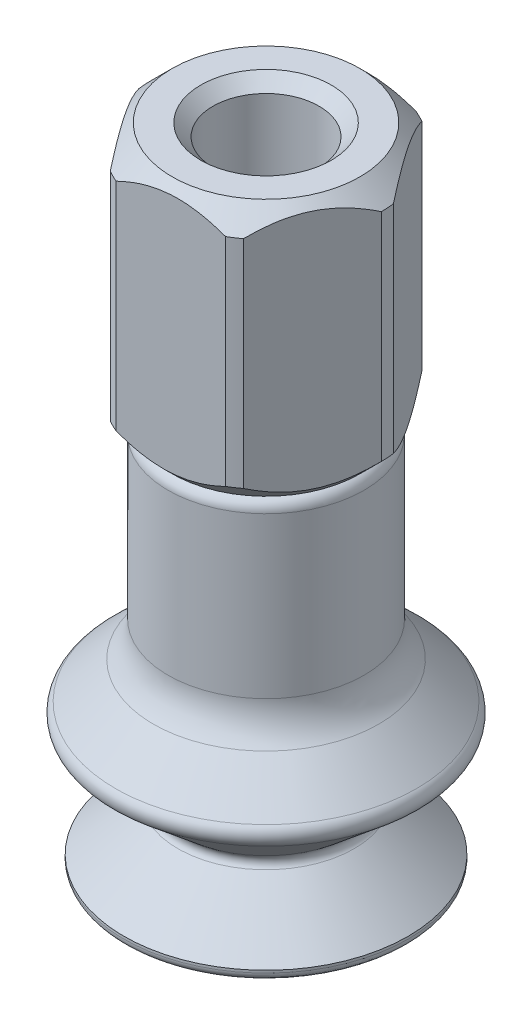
ISO-10303-21;
HEADER;
FILE_DESCRIPTION(('STEP AP214'),'2;1');
FILE_NAME('part.step','',(''),(''),'','','');
FILE_SCHEMA(('AUTOMOTIVE_DESIGN { 1 0 10303 214 1 1 1 1 }'));
ENDSEC;
DATA;
#1=APPLICATION_CONTEXT('core data for automotive mechanical design processes');
#2=APPLICATION_PROTOCOL_DEFINITION('international standard','automotive_design',2000,#1);
#3=PRODUCT_CONTEXT('',#1,'mechanical');
#4=PRODUCT('Part','Part','',(#3));
#5=PRODUCT_RELATED_PRODUCT_CATEGORY('part','',(#4));
#6=PRODUCT_DEFINITION_FORMATION('','',#4);
#7=PRODUCT_DEFINITION_CONTEXT('part definition',#1,'design');
#8=PRODUCT_DEFINITION('design','',#6,#7);
#9=PRODUCT_DEFINITION_SHAPE('','',#8);
#10=(LENGTH_UNIT() NAMED_UNIT(*) SI_UNIT(.MILLI.,.METRE.));
#11=(NAMED_UNIT(*) PLANE_ANGLE_UNIT() SI_UNIT($,.RADIAN.));
#12=(NAMED_UNIT(*) SI_UNIT($,.STERADIAN.) SOLID_ANGLE_UNIT());
#13=UNCERTAINTY_MEASURE_WITH_UNIT(LENGTH_MEASURE(1.E-05),#10,'distance_accuracy_value','');
#14=(GEOMETRIC_REPRESENTATION_CONTEXT(3) GLOBAL_UNCERTAINTY_ASSIGNED_CONTEXT((#13)) GLOBAL_UNIT_ASSIGNED_CONTEXT((#10,
#11,#12)) REPRESENTATION_CONTEXT('',''));
#15=CARTESIAN_POINT('',(0.,0.,0.));
#16=DIRECTION('',(0.,0.,1.));
#17=DIRECTION('',(1.,0.,0.));
#18=AXIS2_PLACEMENT_3D('',#15,#16,#17);
#19=CARTESIAN_POINT('',(-1.23206094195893,0.,5.08418238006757));
#20=DIRECTION('',(0.,1.,0.));
#21=DIRECTION('',(1.,0.,0.));
#22=AXIS2_PLACEMENT_3D('',#19,#20,#21);
#23=CYLINDRICAL_SURFACE('',#22,3.048);
#24=CARTESIAN_POINT('',(-1.23206094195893,-0.381,5.08418238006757));
#25=DIRECTION('',(0.,1.,0.));
#26=DIRECTION('',(1.,0.,0.));
#27=AXIS2_PLACEMENT_3D('',#24,#25,#26);
#28=CIRCLE('',#27,3.048);
#29=CARTESIAN_POINT('',(1.81593905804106,-0.381,5.08418238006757));
#30=VERTEX_POINT('',#29);
#31=EDGE_CURVE('E10',#30,#30,#28,.F.);
#32=ORIENTED_EDGE('',*,*,#31,.T.);
#33=EDGE_LOOP('',(#32));
#34=FACE_BOUND('',#33,.T.);
#35=CARTESIAN_POINT('',(-1.23206094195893,-5.36324630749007,5.08418238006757));
#36=DIRECTION('',(0.,1.,0.));
#37=DIRECTION('',(1.,0.,0.));
#38=AXIS2_PLACEMENT_3D('',#35,#36,#37);
#39=CIRCLE('',#38,3.048);
#40=CARTESIAN_POINT('',(1.81593905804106,-5.36324630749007,5.08418238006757));
#41=VERTEX_POINT('',#40);
#42=EDGE_CURVE('E806',#41,#41,#39,.T.);
#43=ORIENTED_EDGE('',*,*,#42,.T.);
#44=EDGE_LOOP('',(#43));
#45=FACE_BOUND('',#44,.T.);
#46=ADVANCED_FACE('F18',(#34,#45),#23,.T.);
#47=CARTESIAN_POINT('',(-1.23206094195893,-5.36324630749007,5.08418238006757));
#48=DIRECTION('',(0.,1.,0.));
#49=DIRECTION('',(1.,0.,0.));
#50=AXIS2_PLACEMENT_3D('',#47,#48,#49);
#51=TOROIDAL_SURFACE('',#50,4.572,1.524);
#52=CARTESIAN_POINT('',(-1.23206094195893,-6.4516,5.08418238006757));
#53=DIRECTION('',(0.,1.,0.));
#54=DIRECTION('',(1.,0.,0.));
#55=AXIS2_PLACEMENT_3D('',#52,#53,#54);
#56=CIRCLE('',#55,3.5052);
#57=CARTESIAN_POINT('',(2.27313905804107,-6.4516,5.08418238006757));
#58=VERTEX_POINT('',#57);
#59=EDGE_CURVE('E813',#58,#58,#56,.T.);
#60=ORIENTED_EDGE('',*,*,#59,.T.);
#61=EDGE_LOOP('',(#60));
#62=FACE_BOUND('',#61,.T.);
#63=ORIENTED_EDGE('',*,*,#42,.F.);
#64=EDGE_LOOP('',(#63));
#65=FACE_BOUND('',#64,.T.);
#66=ADVANCED_FACE('F643',(#62,#65),#51,.F.);
#67=CARTESIAN_POINT('',(-1.23206094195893,-6.4516,5.08418238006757));
#68=DIRECTION('',(0.,-1.,0.));
#69=DIRECTION('',(-1.,0.,0.));
#70=AXIS2_PLACEMENT_3D('',#67,#68,#69);
#71=CONICAL_SURFACE('',#70,3.5052,0.799358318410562);
#72=CARTESIAN_POINT('',(-1.23206094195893,-7.59820563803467,5.08418238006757));
#73=DIRECTION('',(0.,1.,0.));
#74=DIRECTION('',(1.,0.,0.));
#75=AXIS2_PLACEMENT_3D('',#72,#73,#74);
#76=CIRCLE('',#75,4.68427460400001);
#77=CARTESIAN_POINT('',(3.45221366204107,-7.59820563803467,5.08418238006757));
#78=VERTEX_POINT('',#77);
#79=EDGE_CURVE('E817',#78,#78,#76,.T.);
#80=ORIENTED_EDGE('',*,*,#79,.T.);
#81=EDGE_LOOP('',(#80));
#82=FACE_BOUND('',#81,.T.);
#83=ORIENTED_EDGE('',*,*,#59,.F.);
#84=EDGE_LOOP('',(#83));
#85=FACE_BOUND('',#84,.T.);
#86=ADVANCED_FACE('F636',(#82,#85),#71,.T.);
#87=CARTESIAN_POINT('',(-1.23206094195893,-7.890068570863,5.08418238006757));
#88=DIRECTION('',(0.,1.,0.));
#89=DIRECTION('',(1.,0.,0.));
#90=AXIS2_PLACEMENT_3D('',#87,#88,#89);
#91=TOROIDAL_SURFACE('',#90,4.43937252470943,0.381);
#92=CARTESIAN_POINT('',(-1.23206094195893,-8.18193150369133,5.08418238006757));
#93=DIRECTION('',(0.,1.,0.));
#94=DIRECTION('',(1.,0.,0.));
#95=AXIS2_PLACEMENT_3D('',#92,#93,#94);
#96=CIRCLE('',#95,4.684274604);
#97=CARTESIAN_POINT('',(3.45221366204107,-8.18193150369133,5.08418238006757));
#98=VERTEX_POINT('',#97);
#99=EDGE_CURVE('E390',#98,#98,#96,.T.);
#100=ORIENTED_EDGE('',*,*,#99,.T.);
#101=EDGE_LOOP('',(#100));
#102=FACE_BOUND('',#101,.T.);
#103=ORIENTED_EDGE('',*,*,#79,.F.);
#104=EDGE_LOOP('',(#103));
#105=FACE_BOUND('',#104,.T.);
#106=ADVANCED_FACE('F629',(#102,#105),#91,.T.);
#107=CARTESIAN_POINT('',(-1.23206094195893,-8.18193150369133,5.08418238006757));
#108=DIRECTION('',(0.,1.,0.));
#109=DIRECTION('',(1.,0.,0.));
#110=AXIS2_PLACEMENT_3D('',#107,#108,#109);
#111=CONICAL_SURFACE('',#110,4.684274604,0.872664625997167);
#112=CARTESIAN_POINT('',(-1.23206094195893,-9.8044,5.08418238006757));
#113=DIRECTION('',(0.,1.,0.));
#114=DIRECTION('',(1.,0.,0.));
#115=AXIS2_PLACEMENT_3D('',#112,#113,#114);
#116=CIRCLE('',#115,2.75069194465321);
#117=CARTESIAN_POINT('',(1.51863100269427,-9.8044,5.08418238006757));
#118=VERTEX_POINT('',#117);
#119=EDGE_CURVE('E387',#118,#118,#116,.T.);
#120=ORIENTED_EDGE('',*,*,#119,.T.);
#121=EDGE_LOOP('',(#120));
#122=FACE_BOUND('',#121,.T.);
#123=ORIENTED_EDGE('',*,*,#99,.F.);
#124=EDGE_LOOP('',(#123));
#125=FACE_BOUND('',#124,.T.);
#126=ADVANCED_FACE('F622',(#122,#125),#111,.T.);
#127=CARTESIAN_POINT('',(-1.23206094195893,-9.99897528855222,5.08418238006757));
#128=DIRECTION('',(0.,1.,0.));
#129=DIRECTION('',(1.,0.,0.));
#130=AXIS2_PLACEMENT_3D('',#127,#128,#129);
#131=TOROIDAL_SURFACE('',#130,2.91395999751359,0.254);
#132=CARTESIAN_POINT('',(-1.23206094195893,-10.1870099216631,5.08418238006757));
#133=DIRECTION('',(0.,1.,0.));
#134=DIRECTION('',(1.,0.,0.));
#135=AXIS2_PLACEMENT_3D('',#132,#133,#134);
#136=CIRCLE('',#135,2.7432);
#137=CARTESIAN_POINT('',(1.51113905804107,-10.1870099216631,5.08418238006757));
#138=VERTEX_POINT('',#137);
#139=EDGE_CURVE('E171',#138,#138,#136,.T.);
#140=ORIENTED_EDGE('',*,*,#139,.T.);
#141=EDGE_LOOP('',(#140));
#142=FACE_BOUND('',#141,.T.);
#143=ORIENTED_EDGE('',*,*,#119,.F.);
#144=EDGE_LOOP('',(#143));
#145=FACE_BOUND('',#144,.T.);
#146=ADVANCED_FACE('F615',(#142,#145),#131,.F.);
#147=CARTESIAN_POINT('',(-1.23206094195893,-10.1870099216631,5.08418238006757));
#148=DIRECTION('',(0.,-1.,0.));
#149=DIRECTION('',(-1.,0.,0.));
#150=AXIS2_PLACEMENT_3D('',#147,#148,#149);
#151=CONICAL_SURFACE('',#150,2.7432,0.833507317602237);
#152=CARTESIAN_POINT('',(-1.23206094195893,-11.7094,5.08418238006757));
#153=DIRECTION('',(0.,1.,0.));
#154=DIRECTION('',(1.,0.,0.));
#155=AXIS2_PLACEMENT_3D('',#152,#153,#154);
#156=CIRCLE('',#155,4.4196);
#157=CARTESIAN_POINT('',(3.18753905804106,-11.7094,5.08418238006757));
#158=VERTEX_POINT('',#157);
#159=EDGE_CURVE('E162',#158,#158,#156,.T.);
#160=ORIENTED_EDGE('',*,*,#159,.T.);
#161=EDGE_LOOP('',(#160));
#162=FACE_BOUND('',#161,.T.);
#163=ORIENTED_EDGE('',*,*,#139,.F.);
#164=EDGE_LOOP('',(#163));
#165=FACE_BOUND('',#164,.T.);
#166=ADVANCED_FACE('F608',(#162,#165),#151,.T.);
#167=CARTESIAN_POINT('',(-1.23206094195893,0.,5.08418238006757));
#168=DIRECTION('',(0.,1.,0.));
#169=DIRECTION('',(1.,0.,0.));
#170=AXIS2_PLACEMENT_3D('',#167,#168,#169);
#171=CYLINDRICAL_SURFACE('',#170,4.4196);
#172=CARTESIAN_POINT('',(-1.23206094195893,-11.7856,5.08418238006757));
#173=DIRECTION('',(0.,1.,0.));
#174=DIRECTION('',(1.,0.,0.));
#175=AXIS2_PLACEMENT_3D('',#172,#173,#174);
#176=CIRCLE('',#175,4.4196);
#177=CARTESIAN_POINT('',(3.18753905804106,-11.7856,5.08418238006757));
#178=VERTEX_POINT('',#177);
#179=EDGE_CURVE('E800',#178,#178,#176,.T.);
#180=ORIENTED_EDGE('',*,*,#179,.T.);
#181=EDGE_LOOP('',(#180));
#182=FACE_BOUND('',#181,.T.);
#183=ORIENTED_EDGE('',*,*,#159,.F.);
#184=EDGE_LOOP('',(#183));
#185=FACE_BOUND('',#184,.T.);
#186=ADVANCED_FACE('F602',(#182,#185),#171,.T.);
#187=CARTESIAN_POINT('',(-1.23206094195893,-12.0396,5.08418238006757));
#188=DIRECTION('',(0.,1.,0.));
#189=DIRECTION('',(1.,0.,0.));
#190=AXIS2_PLACEMENT_3D('',#187,#188,#189);
#191=PLANE('',#190);
#192=CARTESIAN_POINT('',(-1.23206094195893,-12.0396,5.08418238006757));
#193=DIRECTION('',(0.,1.,0.));
#194=DIRECTION('',(1.,0.,0.));
#195=AXIS2_PLACEMENT_3D('',#192,#193,#194);
#196=CIRCLE('',#195,4.1656);
#197=CARTESIAN_POINT('',(2.93353905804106,-12.0396,5.08418238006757));
#198=VERTEX_POINT('',#197);
#199=EDGE_CURVE('E795',#198,#198,#196,.F.);
#200=ORIENTED_EDGE('',*,*,#199,.T.);
#201=EDGE_LOOP('',(#200));
#202=FACE_BOUND('',#201,.T.);
#203=ADVANCED_FACE('F596',(#202),#191,.F.);
#204=CARTESIAN_POINT('',(-1.23206094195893,-11.7856,5.08418238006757));
#205=DIRECTION('',(0.,1.,0.));
#206=DIRECTION('',(1.,0.,0.));
#207=AXIS2_PLACEMENT_3D('',#204,#205,#206);
#208=TOROIDAL_SURFACE('',#207,4.1656,0.254);
#209=ORIENTED_EDGE('',*,*,#199,.F.);
#210=EDGE_LOOP('',(#209));
#211=FACE_BOUND('',#210,.T.);
#212=ORIENTED_EDGE('',*,*,#179,.F.);
#213=EDGE_LOOP('',(#212));
#214=FACE_BOUND('',#213,.T.);
#215=ADVANCED_FACE('F591',(#211,#214),#208,.T.);
#216=CARTESIAN_POINT('',(-1.23206094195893,-0.381,5.08418238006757));
#217=DIRECTION('',(0.,1.,0.));
#218=DIRECTION('',(1.,0.,0.));
#219=AXIS2_PLACEMENT_3D('',#216,#217,#218);
#220=TOROIDAL_SURFACE('',#219,2.667,0.381);
#221=ORIENTED_EDGE('',*,*,#31,.F.);
#222=EDGE_LOOP('',(#221));
#223=FACE_BOUND('',#222,.T.);
#224=CARTESIAN_POINT('',(-1.23206094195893,0.,5.08418238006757));
#225=DIRECTION('',(0.,1.,0.));
#226=DIRECTION('',(1.,0.,0.));
#227=AXIS2_PLACEMENT_3D('',#224,#225,#226);
#228=CIRCLE('',#227,2.667);
#229=CARTESIAN_POINT('',(1.43493905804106,0.,5.08418238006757));
#230=VERTEX_POINT('',#229);
#231=EDGE_CURVE('E27',#230,#230,#228,.T.);
#232=ORIENTED_EDGE('',*,*,#231,.F.);
#233=EDGE_LOOP('',(#232));
#234=FACE_BOUND('',#233,.T.);
#235=ADVANCED_FACE('F20',(#223,#234),#220,.T.);
#236=CARTESIAN_POINT('',(-1.23206094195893,-5.207,5.08418238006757));
#237=DIRECTION('',(0.,-1.,0.));
#238=DIRECTION('',(0.0654394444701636,0.,0.997856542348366));
#239=AXIS2_PLACEMENT_3D('',#236,#237,#238);
#240=CYLINDRICAL_SURFACE('',#239,3.556);
#241=CARTESIAN_POINT('',(-1.23206094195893,7.366,5.08418238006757));
#242=DIRECTION('',(0.,-1.,0.));
#243=DIRECTION('',(0.0654394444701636,0.,0.997856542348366));
#244=AXIS2_PLACEMENT_3D('',#241,#242,#243);
#245=CIRCLE('',#244,3.556);
#246=CARTESIAN_POINT('',(0.158145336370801,7.366,1.81119253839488));
#247=VERTEX_POINT('',#246);
#248=CARTESIAN_POINT('',(0.518047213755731,7.366,1.98866022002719));
#249=VERTEX_POINT('',#248);
#250=EDGE_CURVE('E156',#247,#249,#245,.T.);
#251=ORIENTED_EDGE('',*,*,#250,.T.);
#252=DIRECTION('',(0.,-1.,0.));
#253=VECTOR('',#252,1.);
#254=CARTESIAN_POINT('',(0.518047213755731,-5.207,1.98866022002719));
#255=LINE('',#254,#253);
#256=CARTESIAN_POINT('',(0.518047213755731,0.635000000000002,1.98866022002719));
#257=VERTEX_POINT('',#256);
#258=EDGE_CURVE('E154',#249,#257,#255,.T.);
#259=ORIENTED_EDGE('',*,*,#258,.T.);
#260=CARTESIAN_POINT('',(-1.23206094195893,0.635000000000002,5.08418238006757));
#261=DIRECTION('',(0.,1.,0.));
#262=DIRECTION('',(-0.0654394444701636,0.,-0.997856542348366));
#263=AXIS2_PLACEMENT_3D('',#260,#261,#262);
#264=CIRCLE('',#263,3.556);
#265=CARTESIAN_POINT('',(0.158145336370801,0.635000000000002,1.81119253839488));
#266=VERTEX_POINT('',#265);
#267=EDGE_CURVE('E138',#257,#266,#264,.T.);
#268=ORIENTED_EDGE('',*,*,#267,.T.);
#269=DIRECTION('',(0.,-1.,0.));
#270=VECTOR('',#269,1.);
#271=CARTESIAN_POINT('',(0.158145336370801,-5.207,1.81119253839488));
#272=LINE('',#271,#270);
#273=EDGE_CURVE('E320',#266,#247,#272,.F.);
#274=ORIENTED_EDGE('',*,*,#273,.T.);
#275=EDGE_LOOP('',(#251,#259,#268,#274));
#276=FACE_BOUND('',#275,.T.);
#277=ADVANCED_FACE('F155',(#276),#240,.T.);
#278=CARTESIAN_POINT('',(2.32379396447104,0.635000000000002,5.05205942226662));
#279=VERTEX_POINT('',#278);
#280=CARTESIAN_POINT('',(2.29753454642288,0.635000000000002,4.65164141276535));
#281=VERTEX_POINT('',#280);
#282=EDGE_CURVE('E149',#279,#281,#264,.T.);
#283=ORIENTED_EDGE('',*,*,#282,.T.);
#284=DIRECTION('',(0.,-1.,0.));
#285=VECTOR('',#284,1.);
#286=CARTESIAN_POINT('',(2.29753454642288,-5.207,4.65164141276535));
#287=LINE('',#286,#285);
#288=CARTESIAN_POINT('',(2.29753454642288,7.366,4.65164141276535));
#289=VERTEX_POINT('',#288);
#290=EDGE_CURVE('E39',#281,#289,#287,.F.);
#291=ORIENTED_EDGE('',*,*,#290,.T.);
#292=CARTESIAN_POINT('',(2.32379396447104,7.366,5.05205942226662));
#293=VERTEX_POINT('',#292);
#294=EDGE_CURVE('E343',#289,#293,#245,.T.);
#295=ORIENTED_EDGE('',*,*,#294,.T.);
#296=DIRECTION('',(0.,-1.,0.));
#297=VECTOR('',#296,1.);
#298=CARTESIAN_POINT('',(2.32379396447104,-5.207,5.05205942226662));
#299=LINE('',#298,#297);
#300=EDGE_CURVE('E260',#293,#279,#299,.T.);
#301=ORIENTED_EDGE('',*,*,#300,.T.);
#302=EDGE_LOOP('',(#283,#291,#295,#301));
#303=FACE_BOUND('',#302,.T.);
#304=ADVANCED_FACE('F375',(#303),#240,.T.);
#305=CARTESIAN_POINT('',(0.57368580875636,0.635000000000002,8.14758158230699));
#306=VERTEX_POINT('',#305);
#307=CARTESIAN_POINT('',(0.907328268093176,0.635000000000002,7.92463125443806));
#308=VERTEX_POINT('',#307);
#309=EDGE_CURVE('E365',#306,#308,#264,.T.);
#310=ORIENTED_EDGE('',*,*,#309,.T.);
#311=DIRECTION('',(0.,-1.,0.));
#312=VECTOR('',#311,1.);
#313=CARTESIAN_POINT('',(0.907328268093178,-5.207,7.92463125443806));
#314=LINE('',#313,#312);
#315=CARTESIAN_POINT('',(0.907328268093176,7.366,7.92463125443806));
#316=VERTEX_POINT('',#315);
#317=EDGE_CURVE('E207',#308,#316,#314,.F.);
#318=ORIENTED_EDGE('',*,*,#317,.T.);
#319=CARTESIAN_POINT('',(0.57368580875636,7.366,8.14758158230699));
#320=VERTEX_POINT('',#319);
#321=EDGE_CURVE('E350',#316,#320,#245,.T.);
#322=ORIENTED_EDGE('',*,*,#321,.T.);
#323=DIRECTION('',(0.,-1.,0.));
#324=VECTOR('',#323,1.);
#325=CARTESIAN_POINT('',(0.57368580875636,-5.207,8.14758158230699));
#326=LINE('',#325,#324);
#327=EDGE_CURVE('E262',#320,#306,#326,.T.);
#328=ORIENTED_EDGE('',*,*,#327,.T.);
#329=EDGE_LOOP('',(#310,#318,#322,#328));
#330=FACE_BOUND('',#329,.T.);
#331=ADVANCED_FACE('F574',(#330),#240,.T.);
#332=CARTESIAN_POINT('',(-2.98216909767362,0.635000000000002,8.17970454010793));
#333=VERTEX_POINT('',#332);
#334=CARTESIAN_POINT('',(-2.62226722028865,0.635000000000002,8.35717222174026));
#335=VERTEX_POINT('',#334);
#336=EDGE_CURVE('E362',#333,#335,#264,.T.);
#337=ORIENTED_EDGE('',*,*,#336,.T.);
#338=DIRECTION('',(0.,-1.,0.));
#339=VECTOR('',#338,1.);
#340=CARTESIAN_POINT('',(-2.62226722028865,-5.207,8.35717222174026));
#341=LINE('',#340,#339);
#342=CARTESIAN_POINT('',(-2.62226722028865,7.366,8.35717222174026));
#343=VERTEX_POINT('',#342);
#344=EDGE_CURVE('E259',#335,#343,#341,.F.);
#345=ORIENTED_EDGE('',*,*,#344,.T.);
#346=CARTESIAN_POINT('',(-2.98216909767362,7.366,8.17970454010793));
#347=VERTEX_POINT('',#346);
#348=EDGE_CURVE('E356',#343,#347,#245,.T.);
#349=ORIENTED_EDGE('',*,*,#348,.T.);
#350=DIRECTION('',(0.,-1.,0.));
#351=VECTOR('',#350,1.);
#352=CARTESIAN_POINT('',(-2.98216909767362,-5.207,8.17970454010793));
#353=LINE('',#352,#351);
#354=EDGE_CURVE('E281',#347,#333,#353,.T.);
#355=ORIENTED_EDGE('',*,*,#354,.T.);
#356=EDGE_LOOP('',(#337,#345,#349,#355));
#357=FACE_BOUND('',#356,.T.);
#358=ADVANCED_FACE('F569',(#357),#240,.T.);
#359=CARTESIAN_POINT('',(-4.78791584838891,0.635000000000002,5.11630533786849));
#360=VERTEX_POINT('',#359);
#361=CARTESIAN_POINT('',(-4.76165643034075,0.635000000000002,5.51672334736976));
#362=VERTEX_POINT('',#361);
#363=EDGE_CURVE('E358',#360,#362,#264,.T.);
#364=ORIENTED_EDGE('',*,*,#363,.T.);
#365=DIRECTION('',(0.,-1.,0.));
#366=VECTOR('',#365,1.);
#367=CARTESIAN_POINT('',(-4.76165643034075,-5.207,5.51672334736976));
#368=LINE('',#367,#366);
#369=CARTESIAN_POINT('',(-4.76165643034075,7.366,5.51672334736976));
#370=VERTEX_POINT('',#369);
#371=EDGE_CURVE('E274',#362,#370,#368,.F.);
#372=ORIENTED_EDGE('',*,*,#371,.T.);
#373=CARTESIAN_POINT('',(-4.78791584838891,7.366,5.11630533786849));
#374=VERTEX_POINT('',#373);
#375=EDGE_CURVE('E352',#370,#374,#245,.T.);
#376=ORIENTED_EDGE('',*,*,#375,.T.);
#377=DIRECTION('',(0.,-1.,0.));
#378=VECTOR('',#377,1.);
#379=CARTESIAN_POINT('',(-4.78791584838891,-5.207,5.11630533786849));
#380=LINE('',#379,#378);
#381=EDGE_CURVE('E303',#374,#360,#380,.T.);
#382=ORIENTED_EDGE('',*,*,#381,.T.);
#383=EDGE_LOOP('',(#364,#372,#376,#382));
#384=FACE_BOUND('',#383,.T.);
#385=ADVANCED_FACE('F559',(#384),#240,.T.);
#386=CARTESIAN_POINT('',(-2.87952209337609,0.,5.19222290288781));
#387=DIRECTION('',(0.,1.,0.));
#388=DIRECTION('',(-0.0654394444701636,0.,-0.997856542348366));
#389=AXIS2_PLACEMENT_3D('',#386,#387,#388);
#390=PLANE('',#389);
#391=ORIENTED_EDGE('',*,*,#231,.T.);
#392=EDGE_LOOP('',(#391));
#393=FACE_BOUND('',#392,.T.);
#394=CARTESIAN_POINT('',(-1.23206094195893,0.,5.08418238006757));
#395=DIRECTION('',(0.,1.,0.));
#396=DIRECTION('',(-0.0654394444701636,0.,-0.997856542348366));
#397=AXIS2_PLACEMENT_3D('',#394,#395,#396);
#398=CIRCLE('',#397,2.921);
#399=CARTESIAN_POINT('',(-1.42320955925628,0.,2.16944341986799));
#400=VERTEX_POINT('',#399);
#401=EDGE_CURVE('E348',#400,#400,#398,.F.);
#402=ORIENTED_EDGE('',*,*,#401,.T.);
#403=EDGE_LOOP('',(#402));
#404=FACE_BOUND('',#403,.T.);
#405=ADVANCED_FACE('F215',(#393,#404),#390,.F.);
#406=CARTESIAN_POINT('',(-3.03780769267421,0.635000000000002,2.02078317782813));
#407=VERTEX_POINT('',#406);
#408=CARTESIAN_POINT('',(-3.37145015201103,0.635000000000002,2.24373350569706));
#409=VERTEX_POINT('',#408);
#410=EDGE_CURVE('E152',#407,#409,#264,.T.);
#411=ORIENTED_EDGE('',*,*,#410,.T.);
#412=DIRECTION('',(0.,-1.,0.));
#413=VECTOR('',#412,1.);
#414=CARTESIAN_POINT('',(-3.37145015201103,-5.207,2.24373350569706));
#415=LINE('',#414,#413);
#416=CARTESIAN_POINT('',(-3.37145015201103,7.366,2.24373350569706));
#417=VERTEX_POINT('',#416);
#418=EDGE_CURVE('E298',#409,#417,#415,.F.);
#419=ORIENTED_EDGE('',*,*,#418,.T.);
#420=CARTESIAN_POINT('',(-3.03780769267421,7.366,2.02078317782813));
#421=VERTEX_POINT('',#420);
#422=EDGE_CURVE('E340',#417,#421,#245,.T.);
#423=ORIENTED_EDGE('',*,*,#422,.T.);
#424=DIRECTION('',(0.,-1.,0.));
#425=VECTOR('',#424,1.);
#426=CARTESIAN_POINT('',(-3.03780769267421,-5.207,2.02078317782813));
#427=LINE('',#426,#425);
#428=EDGE_CURVE('E326',#421,#407,#427,.T.);
#429=ORIENTED_EDGE('',*,*,#428,.T.);
#430=EDGE_LOOP('',(#411,#419,#423,#429));
#431=FACE_BOUND('',#430,.T.);
#432=ADVANCED_FACE('F552',(#431),#240,.T.);
#433=CARTESIAN_POINT('',(-4.78043880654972,8.001,5.31688504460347));
#434=DIRECTION('',(0.,-1.,0.));
#435=DIRECTION('',(0.0654394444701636,0.,0.997856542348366));
#436=AXIS2_PLACEMENT_3D('',#433,#434,#435);
#437=PLANE('',#436);
#438=CARTESIAN_POINT('',(-1.23206094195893,8.001,5.08418238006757));
#439=DIRECTION('',(0.,1.,0.));
#440=DIRECTION('',(-0.0654394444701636,0.,-0.997856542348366));
#441=AXIS2_PLACEMENT_3D('',#438,#439,#440);
#442=CIRCLE('',#441,2.03);
#443=CARTESIAN_POINT('',(-1.36490301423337,8.001,3.05853359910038));
#444=VERTEX_POINT('',#443);
#445=EDGE_CURVE('E426',#444,#444,#442,.T.);
#446=ORIENTED_EDGE('',*,*,#445,.F.);
#447=EDGE_LOOP('',(#446));
#448=FACE_BOUND('',#447,.T.);
#449=CARTESIAN_POINT('',(-1.23206094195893,8.001,5.08418238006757));
#450=DIRECTION('',(0.,-1.,0.));
#451=DIRECTION('',(0.0654394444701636,0.,0.997856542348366));
#452=AXIS2_PLACEMENT_3D('',#449,#450,#451);
#453=CIRCLE('',#452,2.921);
#454=CARTESIAN_POINT('',(-1.04091232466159,8.001,7.99892134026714));
#455=VERTEX_POINT('',#454);
#456=EDGE_CURVE('E342',#455,#455,#453,.F.);
#457=ORIENTED_EDGE('',*,*,#456,.T.);
#458=EDGE_LOOP('',(#457));
#459=FACE_BOUND('',#458,.T.);
#460=ADVANCED_FACE('F214',(#448,#459),#437,.F.);
#461=CARTESIAN_POINT('',(-1.23206094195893,7.366,5.08418238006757));
#462=DIRECTION('',(0.,-1.,0.));
#463=DIRECTION('',(0.0654394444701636,0.,0.997856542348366));
#464=AXIS2_PLACEMENT_3D('',#461,#462,#463);
#465=CONICAL_SURFACE('',#464,3.556,0.785398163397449);
#466=CARTESIAN_POINT('',(0.517800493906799,7.36579999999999,1.98829100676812));
#467=CARTESIAN_POINT('',(0.580923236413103,7.41696161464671,2.08275342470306));
#468=CARTESIAN_POINT('',(0.645026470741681,7.46460823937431,2.17868313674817));
#469=CARTESIAN_POINT('',(0.775351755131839,7.55088969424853,2.37371334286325));
#470=CARTESIAN_POINT('',(0.841581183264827,7.58948813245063,2.47282487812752));
#471=CARTESIAN_POINT('',(0.974993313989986,7.65484942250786,2.67247451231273));
#472=CARTESIAN_POINT('',(1.04215439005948,7.68175151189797,2.77298024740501));
#473=CARTESIAN_POINT('',(1.17761581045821,7.72233497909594,2.9756966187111));
#474=CARTESIAN_POINT('',(1.24591411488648,7.73603787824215,3.07790420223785));
#475=CARTESIAN_POINT('',(1.37795724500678,7.74860046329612,3.27550514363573));
#476=CARTESIAN_POINT('',(1.44167232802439,7.74846635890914,3.37085399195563));
#477=CARTESIAN_POINT('',(1.5687504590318,7.73585752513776,3.56102487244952));
#478=CARTESIAN_POINT('',(1.63211330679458,7.72337638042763,3.65584660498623));
#479=CARTESIAN_POINT('',(1.75779305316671,7.6870369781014,3.84392481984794));
#480=CARTESIAN_POINT('',(1.82011006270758,7.66317993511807,3.93718146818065));
#481=CARTESIAN_POINT('',(1.94333066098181,7.60564221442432,4.12157959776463));
#482=CARTESIAN_POINT('',(2.00423371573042,7.57195788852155,4.21272027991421));
#483=CARTESIAN_POINT('',(2.10399918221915,7.50932732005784,4.36201808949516));
#484=CARTESIAN_POINT('',(2.14331475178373,7.48266428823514,4.42085336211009));
#485=CARTESIAN_POINT('',(2.22112339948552,7.42636199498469,4.53729305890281));
#486=CARTESIAN_POINT('',(2.25961888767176,7.39673355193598,4.59490108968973));
#487=CARTESIAN_POINT('',(2.29778126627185,7.36580000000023,4.65201062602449));
#488=B_SPLINE_CURVE_WITH_KNOTS('',3,(#466,#467,#468,#469,#470,#471,#472,#473,#474,#475,#476,
#477,#478,#479,#480,#481,#482,#483,#484,#485,#486,#487),.UNSPECIFIED.,.F.,.F.,(4,2,2,2,2,2,2,2,
2,2,4),(0.,0.373990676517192,0.749460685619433,1.12032967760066,1.49059293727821,
1.83395154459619,2.1774886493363,2.52098908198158,2.86461719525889,3.09140700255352,
3.31739767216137),.UNSPECIFIED.);
#489=EDGE_CURVE('E50',#249,#289,#488,.T.);
#490=ORIENTED_EDGE('',*,*,#489,.F.);
#491=ORIENTED_EDGE('',*,*,#250,.F.);
#492=CARTESIAN_POINT('',(6.81044225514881,2.06534289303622,1.3749348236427));
#493=CARTESIAN_POINT('',(6.62383358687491,2.23990488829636,1.38717262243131));
#494=CARTESIAN_POINT('',(6.43686192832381,2.41407951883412,1.39943422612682));
#495=CARTESIAN_POINT('',(6.06199671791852,2.76143140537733,1.42401789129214));
#496=CARTESIAN_POINT('',(5.87410316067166,2.9346086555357,1.4363399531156));
#497=CARTESIAN_POINT('',(5.49672457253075,3.28017682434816,1.46108844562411));
#498=CARTESIAN_POINT('',(5.30723672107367,3.45256465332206,1.47351506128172));
#499=CARTESIAN_POINT('',(4.92686195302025,3.79579115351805,1.49846004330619));
#500=CARTESIAN_POINT('',(4.73597501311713,3.96662979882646,1.51097841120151));
#501=CARTESIAN_POINT('',(4.33300037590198,4.32353779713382,1.53740549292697));
#502=CARTESIAN_POINT('',(4.12072537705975,4.5093952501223,1.55132648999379));
#503=CARTESIAN_POINT('',(3.6933774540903,4.87784226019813,1.57935197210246));
#504=CARTESIAN_POINT('',(3.47830465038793,5.06043195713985,1.59345644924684));
#505=CARTESIAN_POINT('',(3.04469690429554,5.42078593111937,1.62189245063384));
#506=CARTESIAN_POINT('',(2.82616763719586,5.5985570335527,1.63622360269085));
#507=CARTESIAN_POINT('',(2.3838323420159,5.94755054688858,1.66523195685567));
#508=CARTESIAN_POINT('',(2.16002493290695,6.11877121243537,1.67990924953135));
#509=CARTESIAN_POINT('',(1.73814736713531,6.42691642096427,1.70757598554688));
#510=CARTESIAN_POINT('',(1.5410807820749,6.56520220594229,1.72049961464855));
#511=CARTESIAN_POINT('',(1.23999417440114,6.76419752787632,1.74024487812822));
#512=CARTESIAN_POINT('',(1.13874482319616,6.82910780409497,1.74688481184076));
#513=CARTESIAN_POINT('',(0.934092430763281,6.95541096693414,1.76030591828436));
#514=CARTESIAN_POINT('',(0.830689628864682,7.01680424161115,1.7670870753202));
#515=CARTESIAN_POINT('',(0.623549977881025,7.13395313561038,1.78067129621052));
#516=CARTESIAN_POINT('',(0.519864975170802,7.18979956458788,1.7874709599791));
#517=CARTESIAN_POINT('',(0.309817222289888,7.29614961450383,1.80124589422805));
#518=CARTESIAN_POINT('',(0.203453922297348,7.34665212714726,1.80822120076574));
#519=CARTESIAN_POINT('',(-0.119512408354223,7.48778545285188,1.82940133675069));
#520=CARTESIAN_POINT('',(-0.340825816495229,7.56853826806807,1.84391507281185));
#521=CARTESIAN_POINT('',(-0.646106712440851,7.64976048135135,1.8639353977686));
#522=CARTESIAN_POINT('',(-0.725407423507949,7.66822393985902,1.86913593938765));
#523=CARTESIAN_POINT('',(-0.885113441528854,7.69965473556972,1.87960946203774));
#524=CARTESIAN_POINT('',(-0.965518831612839,7.71262165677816,1.88488244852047));
#525=CARTESIAN_POINT('',(-1.12685804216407,7.7325515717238,1.89546307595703));
#526=CARTESIAN_POINT('',(-1.20778991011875,7.73953030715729,1.90077058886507));
#527=CARTESIAN_POINT('',(-1.36994971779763,7.74726516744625,1.91140503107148));
#528=CARTESIAN_POINT('',(-1.45117765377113,7.74802137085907,1.91673196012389));
#529=CARTESIAN_POINT('',(-1.62669836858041,7.7428861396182,1.92824261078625));
#530=CARTESIAN_POINT('',(-1.72096039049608,7.73588992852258,1.93442431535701));
#531=CARTESIAN_POINT('',(-1.90853548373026,7.7138025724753,1.94672549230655));
#532=CARTESIAN_POINT('',(-2.00184836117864,7.69870980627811,1.95284495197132));
#533=CARTESIAN_POINT('',(-2.18800862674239,7.66096358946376,1.96505334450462));
#534=CARTESIAN_POINT('',(-2.28083909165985,7.63822733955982,1.97114116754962));
#535=CARTESIAN_POINT('',(-2.46461178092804,7.58620784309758,1.98319298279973));
#536=CARTESIAN_POINT('',(-2.55555434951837,7.55692580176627,1.98915699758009));
#537=CARTESIAN_POINT('',(-2.75420308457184,7.48612214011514,2.002184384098));
#538=CARTESIAN_POINT('',(-2.86145249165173,7.44332152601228,2.00921780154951));
#539=CARTESIAN_POINT('',(-3.0731321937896,7.35119712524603,2.02309975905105));
#540=CARTESIAN_POINT('',(-3.1775614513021,7.30187097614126,2.02994823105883));
#541=CARTESIAN_POINT('',(-3.38415618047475,7.19785653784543,2.04349671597));
#542=CARTESIAN_POINT('',(-3.48631262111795,7.14315037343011,2.05019613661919));
#543=CARTESIAN_POINT('',(-3.68826802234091,7.02959445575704,2.06344037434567));
#544=CARTESIAN_POINT('',(-3.7880673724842,6.97074539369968,2.06998521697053));
#545=CARTESIAN_POINT('',(-3.9812980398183,6.85237490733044,2.08265728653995));
#546=CARTESIAN_POINT('',(-4.07481674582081,6.79299600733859,2.08879024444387));
#547=CARTESIAN_POINT('',(-4.26024176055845,6.67175325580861,2.10095041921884));
#548=CARTESIAN_POINT('',(-4.35214793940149,6.60988920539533,2.10697762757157));
#549=CARTESIAN_POINT('',(-4.5337992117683,6.48464749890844,2.11889032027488));
#550=CARTESIAN_POINT('',(-4.62355591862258,6.42128669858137,2.12477656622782));
#551=CARTESIAN_POINT('',(-4.80184160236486,6.29290382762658,2.13646854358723));
#552=CARTESIAN_POINT('',(-4.89037091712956,6.22788222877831,2.14227429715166));
#553=CARTESIAN_POINT('',(-4.97838768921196,6.1621829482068,2.1480464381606));
#554=B_SPLINE_CURVE_WITH_KNOTS('',3,(#492,#493,#494,#495,#496,#497,#498,#499,#500,#501,#502,
#503,#504,#505,#506,#507,#508,#509,#510,#511,#512,#513,#514,#515,#516,#517,#518,#519,#520,#521,
#522,#523,#524,#525,#526,#527,#528,#529,#530,#531,#532,#533,#534,#535,#536,#537,#538,#539,#540,
#541,#542,#543,#544,#545,#546,#547,#548,#549,#550,#551,#552,#553),.UNSPECIFIED.,.F.,.F.,(4,2,2,
2,2,2,2,2,2,2,2,2,2,2,2,2,2,2,2,2,2,2,2,2,2,2,2,2,2,2,4),(0.,0.767465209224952,1.53493491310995,
2.30434251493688,3.07376296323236,3.92119224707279,4.7685851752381,5.61470739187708,
6.46105350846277,7.18403565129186,7.54533702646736,7.90659845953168,8.26033303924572,
8.61414083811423,9.31885273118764,9.5634638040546,9.80809338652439,10.052077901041,
10.2960593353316,10.5798493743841,10.8636962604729,11.1507227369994,11.4376964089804,
11.7844836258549,12.1313967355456,12.4795041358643,12.8275535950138,13.1603479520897,
13.4931689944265,13.8232235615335,14.153185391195),.UNSPECIFIED.);
#555=EDGE_CURVE('E150',#421,#247,#554,.F.);
#556=ORIENTED_EDGE('',*,*,#555,.F.);
#557=ORIENTED_EDGE('',*,*,#422,.F.);
#558=CARTESIAN_POINT('',(-4.78811223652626,7.36579999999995,5.1167036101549));
#559=CARTESIAN_POINT('',(-4.73786675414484,7.41696161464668,5.01480650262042));
#560=CARTESIAN_POINT('',(-4.68684080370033,7.46460823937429,4.91132661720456));
#561=CARTESIAN_POINT('',(-4.58310233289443,7.55088969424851,4.7009465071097));
#562=CARTESIAN_POINT('',(-4.53038393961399,7.58948813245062,4.59403437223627));
#563=CARTESIAN_POINT('',(-4.42418834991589,7.65484942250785,4.37867126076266));
#564=CARTESIAN_POINT('',(-4.37072836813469,7.68175151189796,4.27025519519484));
#565=CARTESIAN_POINT('',(-4.26290155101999,7.72233497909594,4.05158397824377));
#566=CARTESIAN_POINT('',(-4.20853633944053,7.73603787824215,3.94133211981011));
#567=CARTESIAN_POINT('',(-4.10343046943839,7.74860046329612,3.72817894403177));
#568=CARTESIAN_POINT('',(-4.05271348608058,7.74846635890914,3.62532563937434));
#569=CARTESIAN_POINT('',(-3.95155973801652,7.73585752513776,3.42018730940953));
#570=CARTESIAN_POINT('',(-3.90112313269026,7.72337638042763,3.31790260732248));
#571=CARTESIAN_POINT('',(-3.80108249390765,7.68703697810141,3.11502164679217));
#572=CARTESIAN_POINT('',(-3.75147837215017,7.66317993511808,3.01442520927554));
#573=CARTESIAN_POINT('',(-3.65339520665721,7.60564221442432,2.81551397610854));
#574=CARTESIAN_POINT('',(-3.60491658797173,7.57195788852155,2.71720004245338));
#575=CARTESIAN_POINT('',(-3.52550362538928,7.50932732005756,2.55615170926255));
#576=CARTESIAN_POINT('',(-3.49420856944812,7.48266428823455,2.49268579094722));
#577=CARTESIAN_POINT('',(-3.4322731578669,7.42636199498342,2.36708167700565));
#578=CARTESIAN_POINT('',(-3.40163088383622,7.39673355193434,2.30493959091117));
#579=CARTESIAN_POINT('',(-3.37125376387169,7.3657999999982,2.24333523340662));
#580=B_SPLINE_CURVE_WITH_KNOTS('',3,(#558,#559,#560,#561,#562,#563,#564,#565,#566,#567,#568,
#569,#570,#571,#572,#573,#574,#575,#576,#577,#578,#579),.UNSPECIFIED.,.F.,.F.,(4,2,2,2,2,2,2,2,
2,2,4),(0.,0.373990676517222,0.749460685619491,1.12032967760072,1.49059293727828,
1.83395154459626,2.17748864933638,2.52098908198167,2.864617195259,3.0914070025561,
3.31739767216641),.UNSPECIFIED.);
#581=EDGE_CURVE('E228',#374,#417,#580,.T.);
#582=ORIENTED_EDGE('',*,*,#581,.F.);
#583=ORIENTED_EDGE('',*,*,#375,.F.);
#584=CARTESIAN_POINT('',(-2.9819223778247,7.3658,8.180073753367));
#585=CARTESIAN_POINT('',(-3.045045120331,7.41696161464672,8.08561133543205));
#586=CARTESIAN_POINT('',(-3.10914835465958,7.46460823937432,7.98968162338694));
#587=CARTESIAN_POINT('',(-3.23947363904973,7.55088969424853,7.79465141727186));
#588=CARTESIAN_POINT('',(-3.30570306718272,7.58948813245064,7.6955398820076));
#589=CARTESIAN_POINT('',(-3.43911519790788,7.65484942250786,7.49589024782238));
#590=CARTESIAN_POINT('',(-3.50627627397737,7.68175151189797,7.3953845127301));
#591=CARTESIAN_POINT('',(-3.6417376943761,7.72233497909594,7.19266814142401));
#592=CARTESIAN_POINT('',(-3.71003599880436,7.73603787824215,7.09046055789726));
#593=CARTESIAN_POINT('',(-3.84207912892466,7.74860046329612,6.89285961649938));
#594=CARTESIAN_POINT('',(-3.90579421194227,7.74846635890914,6.79751076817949));
#595=CARTESIAN_POINT('',(-4.03287234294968,7.73585752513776,6.60733988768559));
#596=CARTESIAN_POINT('',(-4.09623519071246,7.72337638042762,6.51251815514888));
#597=CARTESIAN_POINT('',(-4.22191493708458,7.6870369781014,6.32443994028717));
#598=CARTESIAN_POINT('',(-4.28423194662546,7.66317993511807,6.23118329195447));
#599=CARTESIAN_POINT('',(-4.40745254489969,7.60564221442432,6.04678516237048));
#600=CARTESIAN_POINT('',(-4.46835559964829,7.57195788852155,5.9556444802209));
#601=CARTESIAN_POINT('',(-4.56812106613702,7.50932732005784,5.80634667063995));
#602=CARTESIAN_POINT('',(-4.60743663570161,7.48266428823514,5.74751139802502));
#603=CARTESIAN_POINT('',(-4.6852452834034,7.42636199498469,5.6310717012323));
#604=CARTESIAN_POINT('',(-4.72374077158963,7.39673355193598,5.57346367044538));
#605=CARTESIAN_POINT('',(-4.76190315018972,7.36580000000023,5.51635413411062));
#606=B_SPLINE_CURVE_WITH_KNOTS('',3,(#584,#585,#586,#587,#588,#589,#590,#591,#592,#593,#594,
#595,#596,#597,#598,#599,#600,#601,#602,#603,#604,#605),.UNSPECIFIED.,.F.,.F.,(4,2,2,2,2,2,2,2,
2,2,4),(0.,0.373990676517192,0.749460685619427,1.12032967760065,1.4905929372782,
1.83395154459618,2.17748864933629,2.52098908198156,2.86461719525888,3.09140700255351,
3.31739767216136),.UNSPECIFIED.);
#607=EDGE_CURVE('E237',#347,#370,#606,.T.);
#608=ORIENTED_EDGE('',*,*,#607,.F.);
#609=ORIENTED_EDGE('',*,*,#348,.F.);
#610=CARTESIAN_POINT('',(7.22598272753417,2.0653428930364,7.71132386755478));
#611=CARTESIAN_POINT('',(7.03937405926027,2.23990488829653,7.72356166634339));
#612=CARTESIAN_POINT('',(6.85240240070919,2.41407951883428,7.7358232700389));
#613=CARTESIAN_POINT('',(6.47753719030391,2.76143140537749,7.76040693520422));
#614=CARTESIAN_POINT('',(6.28964363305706,2.93460865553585,7.77272899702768));
#615=CARTESIAN_POINT('',(5.91226504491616,3.2801768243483,7.79747748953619));
#616=CARTESIAN_POINT('',(5.72277719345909,3.4525646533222,7.8099041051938));
#617=CARTESIAN_POINT('',(5.34240242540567,3.79579115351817,7.83484908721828));
#618=CARTESIAN_POINT('',(5.15151548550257,3.96662979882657,7.8473674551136));
#619=CARTESIAN_POINT('',(4.74854084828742,4.32353779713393,7.87379453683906));
#620=CARTESIAN_POINT('',(4.5362658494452,4.50939525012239,7.88771553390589));
#621=CARTESIAN_POINT('',(4.10891792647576,4.87784226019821,7.91574101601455));
#622=CARTESIAN_POINT('',(3.8938451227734,5.06043195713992,7.92984549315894));
#623=CARTESIAN_POINT('',(3.46023737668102,5.42078593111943,7.95828149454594));
#624=CARTESIAN_POINT('',(3.24170810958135,5.59855703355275,7.97261264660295));
#625=CARTESIAN_POINT('',(2.79937281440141,5.94755054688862,8.00162100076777));
#626=CARTESIAN_POINT('',(2.57556540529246,6.1187712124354,8.01629829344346));
#627=CARTESIAN_POINT('',(2.15368783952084,6.4269164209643,8.04396502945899));
#628=CARTESIAN_POINT('',(1.95662125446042,6.56520220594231,8.05688865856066));
#629=CARTESIAN_POINT('',(1.65553464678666,6.76419752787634,8.07663392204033));
#630=CARTESIAN_POINT('',(1.55428529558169,6.82910780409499,8.08327385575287));
#631=CARTESIAN_POINT('',(1.34963290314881,6.95541096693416,8.09669496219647));
#632=CARTESIAN_POINT('',(1.24623010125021,7.01680424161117,8.10347611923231));
#633=CARTESIAN_POINT('',(1.03909045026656,7.13395313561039,8.11706034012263));
#634=CARTESIAN_POINT('',(0.935405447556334,7.18979956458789,8.12386000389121));
#635=CARTESIAN_POINT('',(0.725357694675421,7.29614961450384,8.13763493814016));
#636=CARTESIAN_POINT('',(0.618994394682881,7.34665212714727,8.14461024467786));
#637=CARTESIAN_POINT('',(0.296028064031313,7.48778545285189,8.1657903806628));
#638=CARTESIAN_POINT('',(0.0747146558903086,7.56853826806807,8.18030411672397));
#639=CARTESIAN_POINT('',(-0.230566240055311,7.64976048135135,8.20032444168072));
#640=CARTESIAN_POINT('',(-0.309866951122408,7.66822393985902,8.20552498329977));
#641=CARTESIAN_POINT('',(-0.469572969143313,7.69965473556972,8.21599850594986));
#642=CARTESIAN_POINT('',(-0.549978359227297,7.71262165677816,8.22127149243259));
#643=CARTESIAN_POINT('',(-0.711317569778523,7.7325515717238,8.23185211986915));
#644=CARTESIAN_POINT('',(-0.792249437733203,7.73953030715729,8.2371596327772));
#645=CARTESIAN_POINT('',(-0.954409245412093,7.74726516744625,8.24779407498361));
#646=CARTESIAN_POINT('',(-1.03563718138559,7.74802137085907,8.25312100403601));
#647=CARTESIAN_POINT('',(-1.21115789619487,7.7428861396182,8.26463165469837));
#648=CARTESIAN_POINT('',(-1.30541991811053,7.73588992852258,8.27081335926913));
#649=CARTESIAN_POINT('',(-1.49299501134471,7.7138025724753,8.28311453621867));
#650=CARTESIAN_POINT('',(-1.5863078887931,7.6987098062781,8.28923399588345));
#651=CARTESIAN_POINT('',(-1.77246815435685,7.66096358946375,8.30144238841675));
#652=CARTESIAN_POINT('',(-1.86529861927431,7.63822733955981,8.30753021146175));
#653=CARTESIAN_POINT('',(-2.04907130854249,7.58620784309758,8.31958202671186));
#654=CARTESIAN_POINT('',(-2.14001387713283,7.55692580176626,8.32554604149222));
#655=CARTESIAN_POINT('',(-2.3386626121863,7.48612214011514,8.33857342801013));
#656=CARTESIAN_POINT('',(-2.44591201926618,7.44332152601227,8.34560684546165));
#657=CARTESIAN_POINT('',(-2.65759172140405,7.35119712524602,8.35948880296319));
#658=CARTESIAN_POINT('',(-2.76202097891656,7.30187097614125,8.36633727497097));
#659=CARTESIAN_POINT('',(-2.96861570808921,7.19785653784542,8.37988575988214));
#660=CARTESIAN_POINT('',(-3.07077214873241,7.1431503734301,8.38658518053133));
#661=CARTESIAN_POINT('',(-3.27272754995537,7.02959445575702,8.39982941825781));
#662=CARTESIAN_POINT('',(-3.37252690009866,6.97074539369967,8.40637426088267));
#663=CARTESIAN_POINT('',(-3.56575756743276,6.85237490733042,8.4190463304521));
#664=CARTESIAN_POINT('',(-3.65927627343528,6.79299600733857,8.42517928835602));
#665=CARTESIAN_POINT('',(-3.84470128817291,6.67175325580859,8.43733946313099));
#666=CARTESIAN_POINT('',(-3.93660746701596,6.60988920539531,8.44336667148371));
#667=CARTESIAN_POINT('',(-4.11825873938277,6.48464749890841,8.45527936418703));
#668=CARTESIAN_POINT('',(-4.20801544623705,6.42128669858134,8.46116561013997));
#669=CARTESIAN_POINT('',(-4.38630112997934,6.29290382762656,8.47285758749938));
#670=CARTESIAN_POINT('',(-4.47483044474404,6.22788222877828,8.47866334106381));
#671=CARTESIAN_POINT('',(-4.56284721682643,6.16218294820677,8.48443548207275));
#672=B_SPLINE_CURVE_WITH_KNOTS('',3,(#610,#611,#612,#613,#614,#615,#616,#617,#618,#619,#620,
#621,#622,#623,#624,#625,#626,#627,#628,#629,#630,#631,#632,#633,#634,#635,#636,#637,#638,#639,
#640,#641,#642,#643,#644,#645,#646,#647,#648,#649,#650,#651,#652,#653,#654,#655,#656,#657,#658,
#659,#660,#661,#662,#663,#664,#665,#666,#667,#668,#669,#670,#671),.UNSPECIFIED.,.F.,.F.,(4,2,2,
2,2,2,2,2,2,2,2,2,2,2,2,2,2,2,2,2,2,2,2,2,2,2,2,2,2,2,4),(0.,0.767465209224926,1.5349349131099,
2.30434251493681,3.07376296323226,3.92119224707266,4.76858517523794,5.61470739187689,
6.46105350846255,7.18403565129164,7.54533702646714,7.90659845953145,8.26033303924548,
8.614140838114,9.3188527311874,9.56346380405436,9.80809338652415,10.0520779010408,
10.2960593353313,10.5798493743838,10.8636962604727,11.1507227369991,11.4376964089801,
11.7844836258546,12.1313967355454,12.4795041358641,12.8275535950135,13.1603479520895,
13.4931689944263,13.8232235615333,14.1531853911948),.UNSPECIFIED.);
#673=EDGE_CURVE('E245',#320,#343,#672,.T.);
#674=ORIENTED_EDGE('',*,*,#673,.F.);
#675=ORIENTED_EDGE('',*,*,#321,.F.);
#676=CARTESIAN_POINT('',(2.32399035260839,7.36579999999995,5.05166114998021));
#677=CARTESIAN_POINT('',(2.27374487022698,7.41696161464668,5.15355825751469));
#678=CARTESIAN_POINT('',(2.22271891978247,7.46460823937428,5.25703814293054));
#679=CARTESIAN_POINT('',(2.11898044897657,7.55088969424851,5.4674182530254));
#680=CARTESIAN_POINT('',(2.06626205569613,7.58948813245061,5.57433038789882));
#681=CARTESIAN_POINT('',(1.96006646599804,7.65484942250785,5.78969349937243));
#682=CARTESIAN_POINT('',(1.90660648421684,7.68175151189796,5.89810956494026));
#683=CARTESIAN_POINT('',(1.79877966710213,7.72233497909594,6.11678078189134));
#684=CARTESIAN_POINT('',(1.74441445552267,7.73603787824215,6.227032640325));
#685=CARTESIAN_POINT('',(1.63930858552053,7.74860046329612,6.44018581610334));
#686=CARTESIAN_POINT('',(1.58859160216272,7.74846635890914,6.54303912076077));
#687=CARTESIAN_POINT('',(1.48743785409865,7.73585752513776,6.74817745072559));
#688=CARTESIAN_POINT('',(1.4370012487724,7.72337638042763,6.85046215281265));
#689=CARTESIAN_POINT('',(1.33696060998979,7.6870369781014,7.05334311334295));
#690=CARTESIAN_POINT('',(1.28735648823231,7.66317993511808,7.15393955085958));
#691=CARTESIAN_POINT('',(1.18927332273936,7.60564221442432,7.35285078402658));
#692=CARTESIAN_POINT('',(1.14079470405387,7.57195788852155,7.45116471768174));
#693=CARTESIAN_POINT('',(1.06138174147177,7.50932732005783,7.61221305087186));
#694=CARTESIAN_POINT('',(1.03008668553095,7.48266428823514,7.67567896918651));
#695=CARTESIAN_POINT('',(0.968151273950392,7.42636199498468,7.80128308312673));
#696=CARTESIAN_POINT('',(0.937508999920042,7.39673355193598,7.86342516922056));
#697=CARTESIAN_POINT('',(0.907131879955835,7.36580000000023,7.92502952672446));
#698=B_SPLINE_CURVE_WITH_KNOTS('',3,(#676,#677,#678,#679,#680,#681,#682,#683,#684,#685,#686,
#687,#688,#689,#690,#691,#692,#693,#694,#695,#696,#697),.UNSPECIFIED.,.F.,.F.,(4,2,2,2,2,2,2,2,
2,2,4),(0.,0.373990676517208,0.749460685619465,1.12032967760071,1.49059293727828,
1.83395154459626,2.17748864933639,2.52098908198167,2.864617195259,3.09140700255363,
3.31739767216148),.UNSPECIFIED.);
#699=EDGE_CURVE('E252',#293,#316,#698,.T.);
#700=ORIENTED_EDGE('',*,*,#699,.F.);
#701=ORIENTED_EDGE('',*,*,#294,.F.);
#702=EDGE_LOOP('',(#490,#491,#556,#557,#582,#583,#608,#609,#674,#675,#700,#701));
#703=FACE_BOUND('',#702,.T.);
#704=ORIENTED_EDGE('',*,*,#456,.F.);
#705=EDGE_LOOP('',(#704));
#706=FACE_BOUND('',#705,.T.);
#707=ADVANCED_FACE('F210',(#703,#706),#465,.T.);
#708=CARTESIAN_POINT('',(-1.23206094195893,0.,5.08418238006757));
#709=DIRECTION('',(0.,1.,0.));
#710=DIRECTION('',(-0.0654394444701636,0.,-0.997856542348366));
#711=AXIS2_PLACEMENT_3D('',#708,#709,#710);
#712=CONICAL_SURFACE('',#711,2.921,0.785398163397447);
#713=CARTESIAN_POINT('',(2.29778126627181,0.635200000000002,4.65201062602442));
#714=CARTESIAN_POINT('',(2.2346585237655,0.584038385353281,4.55754820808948));
#715=CARTESIAN_POINT('',(2.17055528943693,0.536391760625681,4.46161849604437));
#716=CARTESIAN_POINT('',(2.04023000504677,0.450110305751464,4.26658828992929));
#717=CARTESIAN_POINT('',(1.97400057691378,0.411511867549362,4.16747675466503));
#718=CARTESIAN_POINT('',(1.84058844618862,0.346150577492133,3.96782712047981));
#719=CARTESIAN_POINT('',(1.77342737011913,0.319248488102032,3.86732138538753));
#720=CARTESIAN_POINT('',(1.6379659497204,0.278665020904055,3.66460501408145));
#721=CARTESIAN_POINT('',(1.56966764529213,0.264962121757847,3.5623974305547));
#722=CARTESIAN_POINT('',(1.43762451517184,0.252399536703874,3.36479648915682));
#723=CARTESIAN_POINT('',(1.37390943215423,0.252533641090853,3.26944764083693));
#724=CARTESIAN_POINT('',(1.24683130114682,0.265142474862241,3.07927676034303));
#725=CARTESIAN_POINT('',(1.18346845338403,0.277623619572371,2.98445502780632));
#726=CARTESIAN_POINT('',(1.05778870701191,0.313963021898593,2.79637681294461));
#727=CARTESIAN_POINT('',(0.995471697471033,0.337820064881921,2.70312016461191));
#728=CARTESIAN_POINT('',(0.872251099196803,0.395357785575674,2.51872203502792));
#729=CARTESIAN_POINT('',(0.811348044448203,0.429042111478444,2.42758135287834));
#730=CARTESIAN_POINT('',(0.711582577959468,0.491672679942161,2.27828354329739));
#731=CARTESIAN_POINT('',(0.672267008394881,0.518335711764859,2.21944827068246));
#732=CARTESIAN_POINT('',(0.594458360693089,0.574638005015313,2.10300857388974));
#733=CARTESIAN_POINT('',(0.555962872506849,0.604266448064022,2.04540054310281));
#734=CARTESIAN_POINT('',(0.517800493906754,0.635199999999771,1.98829100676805));
#735=B_SPLINE_CURVE_WITH_KNOTS('',3,(#713,#714,#715,#716,#717,#718,#719,#720,#721,#722,#723,
#724,#725,#726,#727,#728,#729,#730,#731,#732,#733,#734),.UNSPECIFIED.,.F.,.F.,(4,2,2,2,2,2,2,2,
2,2,4),(0.,0.373990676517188,0.749460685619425,1.12032967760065,1.49059293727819,
1.83395154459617,2.17748864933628,2.52098908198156,2.86461719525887,3.09140700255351,
3.31739767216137),.UNSPECIFIED.);
#736=EDGE_CURVE('E143',#281,#257,#735,.T.);
#737=ORIENTED_EDGE('',*,*,#736,.F.);
#738=ORIENTED_EDGE('',*,*,#282,.F.);
#739=CARTESIAN_POINT('',(0.907131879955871,0.635200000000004,7.92502952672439));
#740=CARTESIAN_POINT('',(0.957377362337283,0.584038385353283,7.82313241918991));
#741=CARTESIAN_POINT('',(1.00840331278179,0.536391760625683,7.71965253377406));
#742=CARTESIAN_POINT('',(1.11214178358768,0.450110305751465,7.50927242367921));
#743=CARTESIAN_POINT('',(1.16486017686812,0.411511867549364,7.4023602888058));
#744=CARTESIAN_POINT('',(1.27105576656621,0.346150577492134,7.1869971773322));
#745=CARTESIAN_POINT('',(1.3245157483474,0.319248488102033,7.07858111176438));
#746=CARTESIAN_POINT('',(1.4323425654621,0.278665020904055,6.85990989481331));
#747=CARTESIAN_POINT('',(1.48670777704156,0.264962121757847,6.74965803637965));
#748=CARTESIAN_POINT('',(1.59181364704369,0.252399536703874,6.53650486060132));
#749=CARTESIAN_POINT('',(1.6425306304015,0.252533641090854,6.43365155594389));
#750=CARTESIAN_POINT('',(1.74368437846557,0.265142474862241,6.22851322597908));
#751=CARTESIAN_POINT('',(1.79412098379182,0.277623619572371,6.12622852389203));
#752=CARTESIAN_POINT('',(1.89416162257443,0.313963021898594,5.92334756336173));
#753=CARTESIAN_POINT('',(1.9437657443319,0.337820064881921,5.8227511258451));
#754=CARTESIAN_POINT('',(2.04184890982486,0.395357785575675,5.62383989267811));
#755=CARTESIAN_POINT('',(2.09032752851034,0.429042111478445,5.52552595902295));
#756=CARTESIAN_POINT('',(2.16974049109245,0.491672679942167,5.36447762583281));
#757=CARTESIAN_POINT('',(2.20103554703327,0.518335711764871,5.30101170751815));
#758=CARTESIAN_POINT('',(2.26297095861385,0.574638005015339,5.17540759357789));
#759=CARTESIAN_POINT('',(2.29361323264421,0.604266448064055,5.11326550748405));
#760=CARTESIAN_POINT('',(2.32399035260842,0.635199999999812,5.05166114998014));
#761=B_SPLINE_CURVE_WITH_KNOTS('',3,(#739,#740,#741,#742,#743,#744,#745,#746,#747,#748,#749,
#750,#751,#752,#753,#754,#755,#756,#757,#758,#759,#760),.UNSPECIFIED.,.F.,.F.,(4,2,2,2,2,2,2,2,
2,2,4),(0.,0.37399067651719,0.749460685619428,1.12032967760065,1.4905929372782,1.83395154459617,
2.17748864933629,2.52098908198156,2.86461719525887,3.09140700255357,3.31739767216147),.UNSPECIFIED.);
#762=EDGE_CURVE('E163',#308,#279,#761,.T.);
#763=ORIENTED_EDGE('',*,*,#762,.F.);
#764=ORIENTED_EDGE('',*,*,#309,.F.);
#765=CARTESIAN_POINT('',(7.22598272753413,5.93565710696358,7.71132386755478));
#766=CARTESIAN_POINT('',(7.03937405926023,5.76109511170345,7.72356166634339));
#767=CARTESIAN_POINT('',(6.85240240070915,5.5869204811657,7.73582327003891));
#768=CARTESIAN_POINT('',(6.47753719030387,5.23956859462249,7.76040693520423));
#769=CARTESIAN_POINT('',(6.28964363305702,5.06639134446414,7.77272899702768));
#770=CARTESIAN_POINT('',(5.91226504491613,4.72082317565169,7.79747748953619));
#771=CARTESIAN_POINT('',(5.72277719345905,4.54843534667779,7.80990410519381));
#772=CARTESIAN_POINT('',(5.34240242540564,4.20520884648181,7.83484908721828));
#773=CARTESIAN_POINT('',(5.15151548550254,4.03437020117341,7.8473674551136));
#774=CARTESIAN_POINT('',(4.74854084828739,3.67746220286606,7.87379453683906));
#775=CARTESIAN_POINT('',(4.53626584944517,3.4916047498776,7.88771553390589));
#776=CARTESIAN_POINT('',(4.10891792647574,3.12315773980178,7.91574101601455));
#777=CARTESIAN_POINT('',(3.89384512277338,2.94056804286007,7.92984549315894));
#778=CARTESIAN_POINT('',(3.460237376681,2.58021406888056,7.95828149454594));
#779=CARTESIAN_POINT('',(3.24170810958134,2.40244296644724,7.97261264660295));
#780=CARTESIAN_POINT('',(2.7993728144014,2.05344945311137,8.00162100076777));
#781=CARTESIAN_POINT('',(2.57556540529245,1.8822287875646,8.01629829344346));
#782=CARTESIAN_POINT('',(2.15368783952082,1.5740835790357,8.04396502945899));
#783=CARTESIAN_POINT('',(1.95662125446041,1.43579779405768,8.05688865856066));
#784=CARTESIAN_POINT('',(1.65553464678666,1.23680247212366,8.07663392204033));
#785=CARTESIAN_POINT('',(1.55428529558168,1.17189219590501,8.08327385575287));
#786=CARTESIAN_POINT('',(1.3496329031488,1.04558903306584,8.09669496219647));
#787=CARTESIAN_POINT('',(1.24623010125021,0.984195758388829,8.10347611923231));
#788=CARTESIAN_POINT('',(1.03909045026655,0.867046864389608,8.11706034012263));
#789=CARTESIAN_POINT('',(0.93540544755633,0.811200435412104,8.12386000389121));
#790=CARTESIAN_POINT('',(0.725357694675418,0.704850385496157,8.13763493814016));
#791=CARTESIAN_POINT('',(0.618994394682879,0.654347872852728,8.14461024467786));
#792=CARTESIAN_POINT('',(0.296028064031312,0.513214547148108,8.1657903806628));
#793=CARTESIAN_POINT('',(0.0747146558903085,0.432461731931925,8.18030411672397));
#794=CARTESIAN_POINT('',(-0.230566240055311,0.351239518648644,8.20032444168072));
#795=CARTESIAN_POINT('',(-0.309866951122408,0.332776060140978,8.20552498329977));
#796=CARTESIAN_POINT('',(-0.469572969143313,0.301345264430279,8.21599850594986));
#797=CARTESIAN_POINT('',(-0.549978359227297,0.288378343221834,8.22127149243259));
#798=CARTESIAN_POINT('',(-0.711317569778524,0.268448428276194,8.23185211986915));
#799=CARTESIAN_POINT('',(-0.792249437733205,0.261469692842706,8.2371596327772));
#800=CARTESIAN_POINT('',(-0.954409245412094,0.253734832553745,8.24779407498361));
#801=CARTESIAN_POINT('',(-1.03563718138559,0.252978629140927,8.25312100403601));
#802=CARTESIAN_POINT('',(-1.21115789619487,0.2581138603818,8.26463165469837));
#803=CARTESIAN_POINT('',(-1.30541991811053,0.265110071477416,8.27081335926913));
#804=CARTESIAN_POINT('',(-1.49299501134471,0.2871974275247,8.28311453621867));
#805=CARTESIAN_POINT('',(-1.58630788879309,0.302290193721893,8.28923399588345));
#806=CARTESIAN_POINT('',(-1.77246815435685,0.340036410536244,8.30144238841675));
#807=CARTESIAN_POINT('',(-1.86529861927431,0.362772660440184,8.30753021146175));
#808=CARTESIAN_POINT('',(-2.04907130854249,0.414792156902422,8.31958202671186));
#809=CARTESIAN_POINT('',(-2.14001387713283,0.444074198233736,8.32554604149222));
#810=CARTESIAN_POINT('',(-2.33866261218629,0.514877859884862,8.33857342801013));
#811=CARTESIAN_POINT('',(-2.44591201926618,0.557678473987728,8.34560684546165));
#812=CARTESIAN_POINT('',(-2.65759172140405,0.649802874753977,8.35948880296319));
#813=CARTESIAN_POINT('',(-2.76202097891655,0.69912902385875,8.36633727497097));
#814=CARTESIAN_POINT('',(-2.9686157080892,0.803143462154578,8.37988575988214));
#815=CARTESIAN_POINT('',(-3.0707721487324,0.857849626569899,8.38658518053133));
#816=CARTESIAN_POINT('',(-3.27272754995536,0.971405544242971,8.39982941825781));
#817=CARTESIAN_POINT('',(-3.37252690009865,1.03025460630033,8.40637426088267));
#818=CARTESIAN_POINT('',(-3.56575756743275,1.14862509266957,8.4190463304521));
#819=CARTESIAN_POINT('',(-3.65927627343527,1.20800399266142,8.42517928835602));
#820=CARTESIAN_POINT('',(-3.8447012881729,1.32924674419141,8.43733946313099));
#821=CARTESIAN_POINT('',(-3.93660746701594,1.39111079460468,8.44336667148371));
#822=CARTESIAN_POINT('',(-4.11825873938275,1.51635250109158,8.45527936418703));
#823=CARTESIAN_POINT('',(-4.20801544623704,1.57971330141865,8.46116561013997));
#824=CARTESIAN_POINT('',(-4.38630112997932,1.70809617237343,8.47285758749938));
#825=CARTESIAN_POINT('',(-4.47483044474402,1.77311777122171,8.47866334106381));
#826=CARTESIAN_POINT('',(-4.56284721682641,1.83881705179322,8.48443548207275));
#827=B_SPLINE_CURVE_WITH_KNOTS('',3,(#765,#766,#767,#768,#769,#770,#771,#772,#773,#774,#775,
#776,#777,#778,#779,#780,#781,#782,#783,#784,#785,#786,#787,#788,#789,#790,#791,#792,#793,#794,
#795,#796,#797,#798,#799,#800,#801,#802,#803,#804,#805,#806,#807,#808,#809,#810,#811,#812,#813,
#814,#815,#816,#817,#818,#819,#820,#821,#822,#823,#824,#825,#826),.UNSPECIFIED.,.F.,.F.,(4,2,2,
2,2,2,2,2,2,2,2,2,2,2,2,2,2,2,2,2,2,2,2,2,2,2,2,2,2,2,4),(0.,0.767465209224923,1.53493491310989,
2.3043425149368,3.07376296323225,3.92119224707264,4.76858517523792,5.61470739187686,
6.46105350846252,7.18403565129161,7.5453370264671,7.90659845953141,8.26033303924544,
8.61414083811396,9.31885273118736,9.56346380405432,9.80809338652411,10.0520779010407,
10.2960593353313,10.5798493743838,10.8636962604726,11.1507227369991,11.4376964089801,
11.7844836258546,12.1313967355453,12.479504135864,12.8275535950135,13.1603479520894,
13.4931689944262,13.8232235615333,14.1531853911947),.UNSPECIFIED.);
#828=EDGE_CURVE('E175',#335,#306,#827,.F.);
#829=ORIENTED_EDGE('',*,*,#828,.F.);
#830=ORIENTED_EDGE('',*,*,#336,.F.);
#831=CARTESIAN_POINT('',(-4.76190315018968,0.635200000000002,5.51635413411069));
#832=CARTESIAN_POINT('',(-4.69878040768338,0.584038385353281,5.61081655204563));
#833=CARTESIAN_POINT('',(-4.6346771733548,0.53639176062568,5.70674626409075));
#834=CARTESIAN_POINT('',(-4.50435188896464,0.450110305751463,5.90177647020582));
#835=CARTESIAN_POINT('',(-4.43812246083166,0.411511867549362,6.00088800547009));
#836=CARTESIAN_POINT('',(-4.3047103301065,0.346150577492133,6.2005376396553));
#837=CARTESIAN_POINT('',(-4.23754925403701,0.319248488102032,6.30104337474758));
#838=CARTESIAN_POINT('',(-4.10208783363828,0.278665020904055,6.50375974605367));
#839=CARTESIAN_POINT('',(-4.03378952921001,0.264962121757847,6.60596732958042));
#840=CARTESIAN_POINT('',(-3.90174639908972,0.252399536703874,6.8035682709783));
#841=CARTESIAN_POINT('',(-3.83803131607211,0.252533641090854,6.89891711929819));
#842=CARTESIAN_POINT('',(-3.7109531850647,0.265142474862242,7.08908799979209));
#843=CARTESIAN_POINT('',(-3.64759033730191,0.277623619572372,7.1839097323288));
#844=CARTESIAN_POINT('',(-3.5219105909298,0.313963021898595,7.3719879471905));
#845=CARTESIAN_POINT('',(-3.45959358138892,0.337820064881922,7.46524459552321));
#846=CARTESIAN_POINT('',(-3.33637298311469,0.395357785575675,7.6496427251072));
#847=CARTESIAN_POINT('',(-3.27546992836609,0.429042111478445,7.74078340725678));
#848=CARTESIAN_POINT('',(-3.17570446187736,0.491672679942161,7.89008121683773));
#849=CARTESIAN_POINT('',(-3.13638889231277,0.518335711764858,7.94891648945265));
#850=CARTESIAN_POINT('',(-3.05858024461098,0.574638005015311,8.06535618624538));
#851=CARTESIAN_POINT('',(-3.02008475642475,0.604266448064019,8.1229642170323));
#852=CARTESIAN_POINT('',(-2.98192237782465,0.635199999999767,8.18007375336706));
#853=B_SPLINE_CURVE_WITH_KNOTS('',3,(#831,#832,#833,#834,#835,#836,#837,#838,#839,#840,#841,
#842,#843,#844,#845,#846,#847,#848,#849,#850,#851,#852),.UNSPECIFIED.,.F.,.F.,(4,2,2,2,2,2,2,2,
2,2,4),(0.,0.373990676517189,0.749460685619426,1.12032967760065,1.4905929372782,
1.83395154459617,2.17748864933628,2.52098908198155,2.86461719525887,3.0914070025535,
3.31739767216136),.UNSPECIFIED.);
#854=EDGE_CURVE('E872',#362,#333,#853,.T.);
#855=ORIENTED_EDGE('',*,*,#854,.F.);
#856=ORIENTED_EDGE('',*,*,#363,.F.);
#857=CARTESIAN_POINT('',(-3.37125376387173,0.63520000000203,2.2433352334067));
#858=CARTESIAN_POINT('',(-3.42149924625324,0.584038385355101,2.34523234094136));
#859=CARTESIAN_POINT('',(-3.47252519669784,0.536391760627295,2.4487122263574));
#860=CARTESIAN_POINT('',(-3.57626366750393,0.450110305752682,2.65909233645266));
#861=CARTESIAN_POINT('',(-3.62898206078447,0.411511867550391,2.76600447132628));
#862=CARTESIAN_POINT('',(-3.73517765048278,0.346150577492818,2.98136758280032));
#863=CARTESIAN_POINT('',(-3.78863763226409,0.319248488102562,3.08978364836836));
#864=CARTESIAN_POINT('',(-3.89646444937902,0.278665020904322,3.3084548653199));
#865=CARTESIAN_POINT('',(-3.95082966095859,0.264962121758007,3.41870672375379));
#866=CARTESIAN_POINT('',(-4.05593553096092,0.252399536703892,3.63185989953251));
#867=CARTESIAN_POINT('',(-4.1066525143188,0.252533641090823,3.73471320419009));
#868=CARTESIAN_POINT('',(-4.20780626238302,0.26514247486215,3.9398515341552));
#869=CARTESIAN_POINT('',(-4.25824286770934,0.277623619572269,4.0421362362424));
#870=CARTESIAN_POINT('',(-4.3582835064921,0.313963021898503,4.24501719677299));
#871=CARTESIAN_POINT('',(-4.40788762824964,0.337820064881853,4.34561363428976));
#872=CARTESIAN_POINT('',(-4.50597079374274,0.395357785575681,4.54452486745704));
#873=CARTESIAN_POINT('',(-4.55444941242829,0.429042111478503,4.64283880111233));
#874=CARTESIAN_POINT('',(-4.63386237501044,0.491672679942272,4.80388713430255));
#875=CARTESIAN_POINT('',(-4.66515743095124,0.518335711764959,4.86735305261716));
#876=CARTESIAN_POINT('',(-4.72709284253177,0.574638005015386,4.99295716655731));
#877=CARTESIAN_POINT('',(-4.7577351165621,0.60426644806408,5.0550992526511));
#878=CARTESIAN_POINT('',(-4.78811223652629,0.635199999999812,5.11670361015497));
#879=B_SPLINE_CURVE_WITH_KNOTS('',3,(#857,#858,#859,#860,#861,#862,#863,#864,#865,#866,#867,
#868,#869,#870,#871,#872,#873,#874,#875,#876,#877,#878),.UNSPECIFIED.,.F.,.F.,(4,2,2,2,2,2,2,2,
2,2,4),(0.,0.373990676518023,0.749460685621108,1.12032967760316,1.49059293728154,1.8339515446,
2.17748864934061,2.52098908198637,2.86461719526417,3.09140700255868,3.3173976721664),.UNSPECIFIED.);
#880=EDGE_CURVE('E867',#409,#360,#879,.T.);
#881=ORIENTED_EDGE('',*,*,#880,.F.);
#882=ORIENTED_EDGE('',*,*,#410,.F.);
#883=CARTESIAN_POINT('',(6.81044225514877,5.93565710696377,1.3749348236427));
#884=CARTESIAN_POINT('',(6.62383358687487,5.76109511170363,1.38717262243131));
#885=CARTESIAN_POINT('',(6.43686192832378,5.58692048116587,1.39943422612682));
#886=CARTESIAN_POINT('',(6.06199671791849,5.23956859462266,1.42401789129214));
#887=CARTESIAN_POINT('',(5.87410316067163,5.06639134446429,1.4363399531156));
#888=CARTESIAN_POINT('',(5.49672457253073,4.72082317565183,1.46108844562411));
#889=CARTESIAN_POINT('',(5.30723672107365,4.54843534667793,1.47351506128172));
#890=CARTESIAN_POINT('',(4.92686195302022,4.20520884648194,1.49846004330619));
#891=CARTESIAN_POINT('',(4.73597501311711,4.03437020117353,1.51097841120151));
#892=CARTESIAN_POINT('',(4.33300037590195,3.67746220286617,1.53740549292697));
#893=CARTESIAN_POINT('',(4.12072537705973,3.4916047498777,1.55132648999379));
#894=CARTESIAN_POINT('',(3.69337745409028,3.12315773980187,1.57935197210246));
#895=CARTESIAN_POINT('',(3.47830465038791,2.94056804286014,1.59345644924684));
#896=CARTESIAN_POINT('',(3.04469690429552,2.58021406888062,1.62189245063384));
#897=CARTESIAN_POINT('',(2.82616763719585,2.4024429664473,1.63622360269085));
#898=CARTESIAN_POINT('',(2.38383234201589,2.05344945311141,1.66523195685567));
#899=CARTESIAN_POINT('',(2.16002493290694,1.88222878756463,1.67990924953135));
#900=CARTESIAN_POINT('',(1.73814736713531,1.57408357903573,1.70757598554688));
#901=CARTESIAN_POINT('',(1.54108078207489,1.43579779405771,1.72049961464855));
#902=CARTESIAN_POINT('',(1.23999417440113,1.23680247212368,1.74024487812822));
#903=CARTESIAN_POINT('',(1.13874482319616,1.17189219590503,1.74688481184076));
#904=CARTESIAN_POINT('',(0.934092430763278,1.04558903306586,1.76030591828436));
#905=CARTESIAN_POINT('',(0.830689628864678,0.984195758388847,1.7670870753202));
#906=CARTESIAN_POINT('',(0.623549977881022,0.867046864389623,1.78067129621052));
#907=CARTESIAN_POINT('',(0.519864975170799,0.811200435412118,1.7874709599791));
#908=CARTESIAN_POINT('',(0.309817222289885,0.704850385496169,1.80124589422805));
#909=CARTESIAN_POINT('',(0.203453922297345,0.654347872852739,1.80822120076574));
#910=CARTESIAN_POINT('',(-0.119512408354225,0.513214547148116,1.82940133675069));
#911=CARTESIAN_POINT('',(-0.34082581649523,0.432461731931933,1.84391507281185));
#912=CARTESIAN_POINT('',(-0.646106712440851,0.351239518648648,1.8639353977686));
#913=CARTESIAN_POINT('',(-0.725407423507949,0.332776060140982,1.86913593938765));
#914=CARTESIAN_POINT('',(-0.885113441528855,0.301345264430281,1.87960946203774));
#915=CARTESIAN_POINT('',(-0.965518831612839,0.288378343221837,1.88488244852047));
#916=CARTESIAN_POINT('',(-1.12685804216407,0.268448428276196,1.89546307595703));
#917=CARTESIAN_POINT('',(-1.20778991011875,0.261469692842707,1.90077058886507));
#918=CARTESIAN_POINT('',(-1.36994971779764,0.253734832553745,1.91140503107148));
#919=CARTESIAN_POINT('',(-1.45117765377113,0.252978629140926,1.91673196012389));
#920=CARTESIAN_POINT('',(-1.62669836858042,0.258113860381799,1.92824261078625));
#921=CARTESIAN_POINT('',(-1.72096039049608,0.265110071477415,1.93442431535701));
#922=CARTESIAN_POINT('',(-1.90853548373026,0.287197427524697,1.94672549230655));
#923=CARTESIAN_POINT('',(-2.00184836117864,0.30229019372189,1.95284495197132));
#924=CARTESIAN_POINT('',(-2.18800862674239,0.34003641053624,1.96505334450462));
#925=CARTESIAN_POINT('',(-2.28083909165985,0.36277266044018,1.97114116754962));
#926=CARTESIAN_POINT('',(-2.46461178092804,0.414792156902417,1.98319298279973));
#927=CARTESIAN_POINT('',(-2.55555434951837,0.444074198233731,1.98915699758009));
#928=CARTESIAN_POINT('',(-2.75420308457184,0.514877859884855,2.002184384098));
#929=CARTESIAN_POINT('',(-2.86145249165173,0.557678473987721,2.00921780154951));
#930=CARTESIAN_POINT('',(-3.07313219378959,0.649802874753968,2.02309975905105));
#931=CARTESIAN_POINT('',(-3.1775614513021,0.69912902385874,2.02994823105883));
#932=CARTESIAN_POINT('',(-3.38415618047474,0.803143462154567,2.04349671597));
#933=CARTESIAN_POINT('',(-3.48631262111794,0.857849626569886,2.05019613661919));
#934=CARTESIAN_POINT('',(-3.6882680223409,0.971405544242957,2.06344037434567));
#935=CARTESIAN_POINT('',(-3.78806737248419,1.03025460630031,2.06998521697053));
#936=CARTESIAN_POINT('',(-3.98129803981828,1.14862509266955,2.08265728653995));
#937=CARTESIAN_POINT('',(-4.0748167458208,1.2080039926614,2.08879024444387));
#938=CARTESIAN_POINT('',(-4.26024176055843,1.32924674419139,2.10095041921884));
#939=CARTESIAN_POINT('',(-4.35214793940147,1.39111079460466,2.10697762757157));
#940=CARTESIAN_POINT('',(-4.53379921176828,1.51635250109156,2.11889032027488));
#941=CARTESIAN_POINT('',(-4.62355591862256,1.57971330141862,2.12477656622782));
#942=CARTESIAN_POINT('',(-4.80184160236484,1.7080961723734,2.13646854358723));
#943=CARTESIAN_POINT('',(-4.89037091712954,1.77311777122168,2.14227429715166));
#944=CARTESIAN_POINT('',(-4.97838768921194,1.83881705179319,2.1480464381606));
#945=B_SPLINE_CURVE_WITH_KNOTS('',3,(#883,#884,#885,#886,#887,#888,#889,#890,#891,#892,#893,
#894,#895,#896,#897,#898,#899,#900,#901,#902,#903,#904,#905,#906,#907,#908,#909,#910,#911,#912,
#913,#914,#915,#916,#917,#918,#919,#920,#921,#922,#923,#924,#925,#926,#927,#928,#929,#930,#931,
#932,#933,#934,#935,#936,#937,#938,#939,#940,#941,#942,#943,#944),.UNSPECIFIED.,.F.,.F.,(4,2,2,
2,2,2,2,2,2,2,2,2,2,2,2,2,2,2,2,2,2,2,2,2,2,2,2,2,2,2,4),(0.,0.767465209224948,1.53493491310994,
2.30434251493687,3.07376296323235,3.92119224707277,4.76858517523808,5.61470739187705,
6.46105350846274,7.18403565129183,7.54533702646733,7.90659845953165,8.26033303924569,
8.6141408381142,9.31885273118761,9.56346380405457,9.80809338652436,10.052077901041,
10.2960593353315,10.579849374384,10.8636962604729,11.1507227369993,11.4376964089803,
11.7844836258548,12.1313967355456,12.4795041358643,12.8275535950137,13.1603479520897,
13.4931689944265,13.8232235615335,14.1531853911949),.UNSPECIFIED.);
#946=EDGE_CURVE('E145',#266,#407,#945,.T.);
#947=ORIENTED_EDGE('',*,*,#946,.F.);
#948=ORIENTED_EDGE('',*,*,#267,.F.);
#949=EDGE_LOOP('',(#737,#738,#763,#764,#829,#830,#855,#856,#881,#882,#947,#948));
#950=FACE_BOUND('',#949,.T.);
#951=ORIENTED_EDGE('',*,*,#401,.F.);
#952=EDGE_LOOP('',(#951));
#953=FACE_BOUND('',#952,.T.);
#954=ADVANCED_FACE('F140',(#950,#953),#712,.T.);
#955=CARTESIAN_POINT('',(-5.05478044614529,-27.2607209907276,2.15305627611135));
#956=DIRECTION('',(0.0654394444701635,0.,0.997856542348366));
#957=DIRECTION('',(0.997856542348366,0.,-0.0654394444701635));
#958=AXIS2_PLACEMENT_3D('',#955,#956,#957);
#959=PLANE('',#958);
#960=ORIENTED_EDGE('',*,*,#428,.F.);
#961=ORIENTED_EDGE('',*,*,#555,.T.);
#962=ORIENTED_EDGE('',*,*,#273,.F.);
#963=ORIENTED_EDGE('',*,*,#946,.T.);
#964=EDGE_LOOP('',(#960,#961,#962,#963));
#965=FACE_BOUND('',#964,.T.);
#966=ADVANCED_FACE('F338',(#965),#959,.F.);
#967=CARTESIAN_POINT('',(-5.6818503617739,-27.0612045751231,6.92919153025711));
#968=DIRECTION('',(0.89688883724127,0.,0.442256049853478));
#969=DIRECTION('',(0.442256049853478,0.,-0.89688883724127));
#970=AXIS2_PLACEMENT_3D('',#967,#968,#969);
#971=PLANE('',#970);
#972=ORIENTED_EDGE('',*,*,#381,.F.);
#973=ORIENTED_EDGE('',*,*,#581,.T.);
#974=ORIENTED_EDGE('',*,*,#418,.F.);
#975=ORIENTED_EDGE('',*,*,#880,.T.);
#976=EDGE_LOOP('',(#972,#973,#974,#975));
#977=FACE_BOUND('',#976,.T.);
#978=ADVANCED_FACE('F532',(#977),#971,.F.);
#979=CARTESIAN_POINT('',(-1.85913085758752,-27.0612045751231,9.86031763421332));
#980=DIRECTION('',(0.831449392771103,0.,-0.55560049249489));
#981=DIRECTION('',(-0.55560049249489,0.,-0.831449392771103));
#982=AXIS2_PLACEMENT_3D('',#979,#980,#981);
#983=PLANE('',#982);
#984=ORIENTED_EDGE('',*,*,#354,.F.);
#985=ORIENTED_EDGE('',*,*,#607,.T.);
#986=ORIENTED_EDGE('',*,*,#371,.F.);
#987=ORIENTED_EDGE('',*,*,#854,.T.);
#988=EDGE_LOOP('',(#984,#985,#986,#987));
#989=FACE_BOUND('',#988,.T.);
#990=ADVANCED_FACE('F527',(#989),#983,.F.);
#991=CARTESIAN_POINT('',(2.59065856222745,-27.0612045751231,8.01530848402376));
#992=DIRECTION('',(-0.0654394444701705,0.,-0.997856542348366));
#993=DIRECTION('',(-0.997856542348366,0.,0.0654394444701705));
#994=AXIS2_PLACEMENT_3D('',#991,#992,#993);
#995=PLANE('',#994);
#996=ORIENTED_EDGE('',*,*,#327,.F.);
#997=ORIENTED_EDGE('',*,*,#673,.T.);
#998=ORIENTED_EDGE('',*,*,#344,.F.);
#999=ORIENTED_EDGE('',*,*,#828,.T.);
#1000=EDGE_LOOP('',(#996,#997,#998,#999));
#1001=FACE_BOUND('',#1000,.T.);
#1002=ADVANCED_FACE('F522',(#1001),#995,.F.);
#1003=CARTESIAN_POINT('',(3.21772847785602,-27.0612045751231,3.23917322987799));
#1004=DIRECTION('',(-0.896888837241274,0.,-0.442256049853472));
#1005=DIRECTION('',(-0.442256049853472,0.,0.896888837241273));
#1006=AXIS2_PLACEMENT_3D('',#1003,#1004,#1005);
#1007=PLANE('',#1006);
#1008=ORIENTED_EDGE('',*,*,#300,.F.);
#1009=ORIENTED_EDGE('',*,*,#699,.T.);
#1010=ORIENTED_EDGE('',*,*,#317,.F.);
#1011=ORIENTED_EDGE('',*,*,#762,.T.);
#1012=EDGE_LOOP('',(#1008,#1009,#1010,#1011));
#1013=FACE_BOUND('',#1012,.T.);
#1014=ADVANCED_FACE('F195',(#1013),#1007,.F.);
#1015=CARTESIAN_POINT('',(-0.60499102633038,-27.0612045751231,0.308047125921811));
#1016=DIRECTION('',(-0.831449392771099,0.,0.555600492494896));
#1017=DIRECTION('',(0.555600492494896,0.,0.831449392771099));
#1018=AXIS2_PLACEMENT_3D('',#1015,#1016,#1017);
#1019=PLANE('',#1018);
#1020=ORIENTED_EDGE('',*,*,#258,.F.);
#1021=ORIENTED_EDGE('',*,*,#489,.T.);
#1022=ORIENTED_EDGE('',*,*,#290,.F.);
#1023=ORIENTED_EDGE('',*,*,#736,.T.);
#1024=EDGE_LOOP('',(#1020,#1021,#1022,#1023));
#1025=FACE_BOUND('',#1024,.T.);
#1026=ADVANCED_FACE('F160',(#1025),#1019,.F.);
#1027=CARTESIAN_POINT('',(-1.23206094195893,1.651,5.08418238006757));
#1028=DIRECTION('',(0.,1.,0.));
#1029=DIRECTION('',(-0.0654394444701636,0.,-0.997856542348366));
#1030=AXIS2_PLACEMENT_3D('',#1027,#1028,#1029);
#1031=PLANE('',#1030);
#1032=CARTESIAN_POINT('',(-1.23206094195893,1.651,5.08418238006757));
#1033=DIRECTION('',(0.,1.,0.));
#1034=DIRECTION('',(-0.0654394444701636,0.,-0.997856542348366));
#1035=AXIS2_PLACEMENT_3D('',#1032,#1033,#1034);
#1036=CIRCLE('',#1035,1.65);
#1037=CARTESIAN_POINT('',(-1.3400360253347,1.651,3.43771908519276));
#1038=VERTEX_POINT('',#1037);
#1039=EDGE_CURVE('E438',#1038,#1038,#1036,.T.);
#1040=ORIENTED_EDGE('',*,*,#1039,.T.);
#1041=EDGE_LOOP('',(#1040));
#1042=FACE_BOUND('',#1041,.T.);
#1043=ADVANCED_FACE('F194',(#1042),#1031,.T.);
#1044=CARTESIAN_POINT('',(-1.23206094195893,8.001,5.08418238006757));
#1045=DIRECTION('',(0.,1.,0.));
#1046=DIRECTION('',(-0.0654394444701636,0.,-0.997856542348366));
#1047=AXIS2_PLACEMENT_3D('',#1044,#1045,#1046);
#1048=CYLINDRICAL_SURFACE('',#1047,1.64999999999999);
#1049=ORIENTED_EDGE('',*,*,#1039,.F.);
#1050=EDGE_LOOP('',(#1049));
#1051=FACE_BOUND('',#1050,.T.);
#1052=CARTESIAN_POINT('',(-1.23206094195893,7.62099999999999,5.08418238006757));
#1053=DIRECTION('',(0.,1.,0.));
#1054=DIRECTION('',(-0.0654394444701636,0.,-0.997856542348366));
#1055=AXIS2_PLACEMENT_3D('',#1052,#1053,#1054);
#1056=CIRCLE('',#1055,1.64999999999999);
#1057=CARTESIAN_POINT('',(-1.3400360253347,7.62099999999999,3.43771908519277));
#1058=VERTEX_POINT('',#1057);
#1059=EDGE_CURVE('E429',#1058,#1058,#1056,.T.);
#1060=ORIENTED_EDGE('',*,*,#1059,.T.);
#1061=EDGE_LOOP('',(#1060));
#1062=FACE_BOUND('',#1061,.T.);
#1063=ADVANCED_FACE('F453',(#1051,#1062),#1048,.F.);
#1064=CARTESIAN_POINT('',(-1.23206094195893,8.001,5.08418238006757));
#1065=DIRECTION('',(0.,1.,0.));
#1066=DIRECTION('',(-0.0654394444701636,0.,-0.997856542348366));
#1067=AXIS2_PLACEMENT_3D('',#1064,#1065,#1066);
#1068=CONICAL_SURFACE('',#1067,2.03,0.785398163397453);
#1069=ORIENTED_EDGE('',*,*,#1059,.F.);
#1070=EDGE_LOOP('',(#1069));
#1071=FACE_BOUND('',#1070,.T.);
#1072=ORIENTED_EDGE('',*,*,#445,.T.);
#1073=EDGE_LOOP('',(#1072));
#1074=FACE_BOUND('',#1073,.T.);
#1075=ADVANCED_FACE('F465',(#1071,#1074),#1068,.F.);
#1076=CLOSED_SHELL('',(#46,#66,#86,#106,#126,#146,#166,#186,#203,#215,#235,#277,#304,#331,#358,
#385,#405,#432,#460,#707,#954,#966,#978,#990,#1002,#1014,#1026,#1043,#1063,#1075));
#1077=CARTESIAN_POINT('',(-1.23206094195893,0.,5.08418238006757));
#1078=DIRECTION('',(0.,-1.,0.));
#1079=DIRECTION('',(0.,0.,-1.));
#1080=AXIS2_PLACEMENT_3D('',#1077,#1078,#1079);
#1081=PLANE('',#1080);
#1082=CARTESIAN_POINT('',(-1.23206094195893,0.,5.08418238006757));
#1083=DIRECTION('',(0.,-1.,0.));
#1084=DIRECTION('',(0.0654394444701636,0.,0.997856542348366));
#1085=AXIS2_PLACEMENT_3D('',#1082,#1083,#1084);
#1086=CIRCLE('',#1085,0.5842);
#1087=CARTESIAN_POINT('',(-1.19383121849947,0.,5.66713017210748));
#1088=VERTEX_POINT('',#1087);
#1089=EDGE_CURVE('E442',#1088,#1088,#1086,.F.);
#1090=ORIENTED_EDGE('',*,*,#1089,.T.);
#1091=EDGE_LOOP('',(#1090));
#1092=FACE_BOUND('',#1091,.T.);
#1093=ADVANCED_FACE('F196',(#1092),#1081,.F.);
#1094=CARTESIAN_POINT('',(-1.23206094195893,1.01060275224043,5.08418238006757));
#1095=DIRECTION('',(0.,1.,0.));
#1096=DIRECTION('',(-0.0654394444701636,0.,-0.997856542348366));
#1097=AXIS2_PLACEMENT_3D('',#1094,#1095,#1096);
#1098=PLANE('',#1097);
#1099=CARTESIAN_POINT('',(-1.23206094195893,1.01060275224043,5.08418238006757));
#1100=DIRECTION('',(0.,1.,0.));
#1101=DIRECTION('',(-0.0654394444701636,0.,-0.997856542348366));
#1102=AXIS2_PLACEMENT_3D('',#1099,#1100,#1101);
#1103=CIRCLE('',#1102,0.5842);
#1104=CARTESIAN_POINT('',(-1.2702906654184,1.01060275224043,4.50123458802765));
#1105=VERTEX_POINT('',#1104);
#1106=EDGE_CURVE('E424',#1105,#1105,#1103,.T.);
#1107=ORIENTED_EDGE('',*,*,#1106,.F.);
#1108=EDGE_LOOP('',(#1107));
#1109=FACE_BOUND('',#1108,.T.);
#1110=ADVANCED_FACE('F489',(#1109),#1098,.F.);
#1111=CARTESIAN_POINT('',(-1.23206094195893,8.001,5.08418238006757));
#1112=DIRECTION('',(0.,-1.,0.));
#1113=DIRECTION('',(0.0654394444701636,0.,0.997856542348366));
#1114=AXIS2_PLACEMENT_3D('',#1111,#1112,#1113);
#1115=CYLINDRICAL_SURFACE('',#1114,0.5842);
#1116=ORIENTED_EDGE('',*,*,#1106,.T.);
#1117=EDGE_LOOP('',(#1116));
#1118=FACE_BOUND('',#1117,.T.);
#1119=ORIENTED_EDGE('',*,*,#1089,.F.);
#1120=EDGE_LOOP('',(#1119));
#1121=FACE_BOUND('',#1120,.T.);
#1122=ADVANCED_FACE('F434',(#1118,#1121),#1115,.F.);
#1123=CLOSED_SHELL('',(#1093,#1110,#1122));
#1124=ORIENTED_CLOSED_SHELL('',*,#1123,.T.);
#1125=BREP_WITH_VOIDS('B1',#1076,(#1124));
#1126=ADVANCED_BREP_SHAPE_REPRESENTATION('',(#18,#1125),#14);
#1127=SHAPE_DEFINITION_REPRESENTATION(#9,#1126);
ENDSEC;
END-ISO-10303-21;
